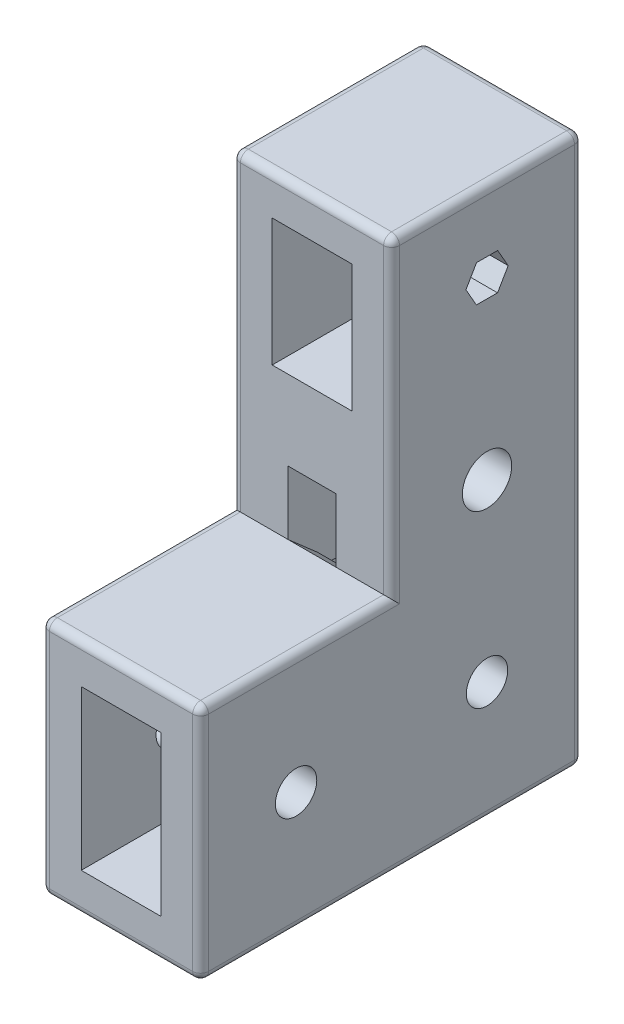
ISO-10303-21;
HEADER;
FILE_DESCRIPTION(('STEP AP214'),'2;1');
FILE_NAME('part.step','',(''),(''),'','','');
FILE_SCHEMA(('AUTOMOTIVE_DESIGN { 1 0 10303 214 1 1 1 1 }'));
ENDSEC;
DATA;
#1=APPLICATION_CONTEXT('core data for automotive mechanical design processes');
#2=APPLICATION_PROTOCOL_DEFINITION('international standard','automotive_design',2000,#1);
#3=PRODUCT_CONTEXT('',#1,'mechanical');
#4=PRODUCT('Part','Part','',(#3));
#5=PRODUCT_RELATED_PRODUCT_CATEGORY('part','',(#4));
#6=PRODUCT_DEFINITION_FORMATION('','',#4);
#7=PRODUCT_DEFINITION_CONTEXT('part definition',#1,'design');
#8=PRODUCT_DEFINITION('design','',#6,#7);
#9=PRODUCT_DEFINITION_SHAPE('','',#8);
#10=(LENGTH_UNIT() NAMED_UNIT(*) SI_UNIT(.MILLI.,.METRE.));
#11=(NAMED_UNIT(*) PLANE_ANGLE_UNIT() SI_UNIT($,.RADIAN.));
#12=(NAMED_UNIT(*) SI_UNIT($,.STERADIAN.) SOLID_ANGLE_UNIT());
#13=UNCERTAINTY_MEASURE_WITH_UNIT(LENGTH_MEASURE(1.E-05),#10,'distance_accuracy_value','');
#14=(GEOMETRIC_REPRESENTATION_CONTEXT(3) GLOBAL_UNCERTAINTY_ASSIGNED_CONTEXT((#13)) GLOBAL_UNIT_ASSIGNED_CONTEXT((#10,
#11,#12)) REPRESENTATION_CONTEXT('',''));
#15=CARTESIAN_POINT('',(0.,0.,0.));
#16=DIRECTION('',(0.,0.,1.));
#17=DIRECTION('',(1.,0.,0.));
#18=AXIS2_PLACEMENT_3D('',#15,#16,#17);
#19=CARTESIAN_POINT('',(0.,23.7785314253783,-9.30263413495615));
#20=DIRECTION('',(0.,0.496875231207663,-0.867821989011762));
#21=DIRECTION('',(0.,0.867821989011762,0.496875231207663));
#22=AXIS2_PLACEMENT_3D('',#19,#20,#21);
#23=PLANE('',#22);
#24=DIRECTION('',(1.,0.,0.));
#25=VECTOR('',#24,1.);
#26=CARTESIAN_POINT('',(0.,26.0833028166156,-7.9830273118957));
#27=LINE('',#26,#25);
#28=CARTESIAN_POINT('',(15.,26.0833028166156,-7.9830273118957));
#29=VERTEX_POINT('',#28);
#30=CARTESIAN_POINT('',(20.,26.0833028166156,-7.9830273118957));
#31=VERTEX_POINT('',#30);
#32=EDGE_CURVE('E823',#29,#31,#27,.T.);
#33=ORIENTED_EDGE('',*,*,#32,.F.);
#34=DIRECTION('',(0.,-0.867821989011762,-0.496875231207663));
#35=VECTOR('',#34,1.);
#36=CARTESIAN_POINT('',(15.,23.7785314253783,-9.30263413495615));
#37=LINE('',#36,#35);
#38=CARTESIAN_POINT('',(15.,23.7785314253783,-9.30263413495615));
#39=VERTEX_POINT('',#38);
#40=EDGE_CURVE('E463',#29,#39,#37,.T.);
#41=ORIENTED_EDGE('',*,*,#40,.T.);
#42=DIRECTION('',(1.,0.,0.));
#43=VECTOR('',#42,1.);
#44=CARTESIAN_POINT('',(0.,23.7785314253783,-9.30263413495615));
#45=LINE('',#44,#43);
#46=CARTESIAN_POINT('',(20.,23.7785314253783,-9.30263413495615));
#47=VERTEX_POINT('',#46);
#48=EDGE_CURVE('E748',#39,#47,#45,.T.);
#49=ORIENTED_EDGE('',*,*,#48,.T.);
#50=DIRECTION('',(0.,0.867821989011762,0.496875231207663));
#51=VECTOR('',#50,1.);
#52=CARTESIAN_POINT('',(20.,23.7785314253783,-9.30263413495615));
#53=LINE('',#52,#51);
#54=EDGE_CURVE('E773',#47,#31,#53,.T.);
#55=ORIENTED_EDGE('',*,*,#54,.T.);
#56=EDGE_LOOP('',(#33,#41,#49,#55));
#57=FACE_BOUND('',#56,.T.);
#58=ADVANCED_FACE('F52',(#57),#23,.F.);
#59=CARTESIAN_POINT('',(0.,21.4833326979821,-7.96644697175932));
#60=DIRECTION('',(0.,-0.503118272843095,-0.864217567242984));
#61=DIRECTION('',(0.,0.864217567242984,-0.503118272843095));
#62=AXIS2_PLACEMENT_3D('',#59,#60,#61);
#63=PLANE('',#62);
#64=ORIENTED_EDGE('',*,*,#48,.F.);
#65=DIRECTION('',(0.,-0.864217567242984,0.503118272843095));
#66=VECTOR('',#65,1.);
#67=CARTESIAN_POINT('',(15.,21.4833326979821,-7.96644697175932));
#68=LINE('',#67,#66);
#69=CARTESIAN_POINT('',(15.,21.4833326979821,-7.96644697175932));
#70=VERTEX_POINT('',#69);
#71=EDGE_CURVE('E460',#39,#70,#68,.T.);
#72=ORIENTED_EDGE('',*,*,#71,.T.);
#73=DIRECTION('',(1.,0.,0.));
#74=VECTOR('',#73,1.);
#75=CARTESIAN_POINT('',(0.,21.4833326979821,-7.96644697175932));
#76=LINE('',#75,#74);
#77=CARTESIAN_POINT('',(20.,21.4833326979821,-7.96644697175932));
#78=VERTEX_POINT('',#77);
#79=EDGE_CURVE('E744',#70,#78,#76,.T.);
#80=ORIENTED_EDGE('',*,*,#79,.T.);
#81=DIRECTION('',(0.,0.864217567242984,-0.503118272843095));
#82=VECTOR('',#81,1.);
#83=CARTESIAN_POINT('',(20.,21.4833326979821,-7.96644697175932));
#84=LINE('',#83,#82);
#85=EDGE_CURVE('E752',#78,#47,#84,.T.);
#86=ORIENTED_EDGE('',*,*,#85,.T.);
#87=EDGE_LOOP('',(#64,#72,#80,#86));
#88=FACE_BOUND('',#87,.T.);
#89=ADVANCED_FACE('F708',(#88),#63,.F.);
#90=CARTESIAN_POINT('',(0.,21.4929053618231,-5.31065298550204));
#91=DIRECTION('',(0.,-0.999993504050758,0.00360442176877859));
#92=DIRECTION('',(0.,-0.00360442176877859,-0.999993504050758));
#93=AXIS2_PLACEMENT_3D('',#90,#91,#92);
#94=PLANE('',#93);
#95=ORIENTED_EDGE('',*,*,#79,.F.);
#96=DIRECTION('',(0.,0.00360442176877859,0.999993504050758));
#97=VECTOR('',#96,1.);
#98=CARTESIAN_POINT('',(15.,21.4929053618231,-5.31065298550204));
#99=LINE('',#98,#97);
#100=CARTESIAN_POINT('',(15.,21.4929053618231,-5.31065298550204));
#101=VERTEX_POINT('',#100);
#102=EDGE_CURVE('E455',#70,#101,#99,.T.);
#103=ORIENTED_EDGE('',*,*,#102,.T.);
#104=DIRECTION('',(1.,0.,0.));
#105=VECTOR('',#104,1.);
#106=CARTESIAN_POINT('',(0.,21.4929053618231,-5.31065298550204));
#107=LINE('',#106,#105);
#108=CARTESIAN_POINT('',(20.,21.4929053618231,-5.31065298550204));
#109=VERTEX_POINT('',#108);
#110=EDGE_CURVE('E803',#101,#109,#107,.T.);
#111=ORIENTED_EDGE('',*,*,#110,.T.);
#112=DIRECTION('',(0.,-0.00360442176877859,-0.999993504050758));
#113=VECTOR('',#112,1.);
#114=CARTESIAN_POINT('',(20.,21.4929053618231,-5.31065298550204));
#115=LINE('',#114,#113);
#116=EDGE_CURVE('E757',#109,#78,#115,.T.);
#117=ORIENTED_EDGE('',*,*,#116,.T.);
#118=EDGE_LOOP('',(#95,#103,#111,#117));
#119=FACE_BOUND('',#118,.T.);
#120=ADVANCED_FACE('F719',(#119),#94,.F.);
#121=CARTESIAN_POINT('',(0.,23.7976767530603,-3.9910461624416));
#122=DIRECTION('',(0.,-0.496875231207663,0.867821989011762));
#123=DIRECTION('',(0.,-0.867821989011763,-0.496875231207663));
#124=AXIS2_PLACEMENT_3D('',#121,#122,#123);
#125=PLANE('',#124);
#126=ORIENTED_EDGE('',*,*,#110,.F.);
#127=DIRECTION('',(0.,0.867821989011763,0.496875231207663));
#128=VECTOR('',#127,1.);
#129=CARTESIAN_POINT('',(15.,23.7976767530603,-3.9910461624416));
#130=LINE('',#129,#128);
#131=CARTESIAN_POINT('',(15.,23.7976767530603,-3.99104616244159));
#132=VERTEX_POINT('',#131);
#133=EDGE_CURVE('E446',#101,#132,#130,.T.);
#134=ORIENTED_EDGE('',*,*,#133,.T.);
#135=DIRECTION('',(1.,0.,0.));
#136=VECTOR('',#135,1.);
#137=CARTESIAN_POINT('',(0.,23.7976767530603,-3.9910461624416));
#138=LINE('',#137,#136);
#139=CARTESIAN_POINT('',(20.,23.7976767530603,-3.9910461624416));
#140=VERTEX_POINT('',#139);
#141=EDGE_CURVE('E812',#132,#140,#138,.T.);
#142=ORIENTED_EDGE('',*,*,#141,.T.);
#143=DIRECTION('',(0.,-0.867821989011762,-0.496875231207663));
#144=VECTOR('',#143,1.);
#145=CARTESIAN_POINT('',(20.,23.7976767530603,-3.9910461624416));
#146=LINE('',#145,#144);
#147=EDGE_CURVE('E763',#140,#109,#146,.T.);
#148=ORIENTED_EDGE('',*,*,#147,.T.);
#149=EDGE_LOOP('',(#126,#134,#142,#148));
#150=FACE_BOUND('',#149,.T.);
#151=ADVANCED_FACE('F947',(#150),#125,.F.);
#152=CARTESIAN_POINT('',(0.,26.0928754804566,-5.32723332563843));
#153=DIRECTION('',(0.,0.503118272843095,0.864217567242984));
#154=DIRECTION('',(0.,-0.864217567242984,0.503118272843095));
#155=AXIS2_PLACEMENT_3D('',#152,#153,#154);
#156=PLANE('',#155);
#157=ORIENTED_EDGE('',*,*,#141,.F.);
#158=DIRECTION('',(0.,0.864217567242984,-0.503118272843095));
#159=VECTOR('',#158,1.);
#160=CARTESIAN_POINT('',(15.,26.0928754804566,-5.32723332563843));
#161=LINE('',#160,#159);
#162=CARTESIAN_POINT('',(15.,26.0928754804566,-5.32723332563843));
#163=VERTEX_POINT('',#162);
#164=EDGE_CURVE('E444',#132,#163,#161,.T.);
#165=ORIENTED_EDGE('',*,*,#164,.T.);
#166=DIRECTION('',(1.,0.,0.));
#167=VECTOR('',#166,1.);
#168=CARTESIAN_POINT('',(0.,26.0928754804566,-5.32723332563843));
#169=LINE('',#168,#167);
#170=CARTESIAN_POINT('',(20.,26.0928754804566,-5.32723332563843));
#171=VERTEX_POINT('',#170);
#172=EDGE_CURVE('E816',#163,#171,#169,.T.);
#173=ORIENTED_EDGE('',*,*,#172,.T.);
#174=DIRECTION('',(0.,-0.864217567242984,0.503118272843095));
#175=VECTOR('',#174,1.);
#176=CARTESIAN_POINT('',(20.,26.0928754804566,-5.32723332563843));
#177=LINE('',#176,#175);
#178=EDGE_CURVE('E770',#171,#140,#177,.T.);
#179=ORIENTED_EDGE('',*,*,#178,.T.);
#180=EDGE_LOOP('',(#157,#165,#173,#179));
#181=FACE_BOUND('',#180,.T.);
#182=ADVANCED_FACE('F952',(#181),#156,.F.);
#183=CARTESIAN_POINT('',(0.,26.0833028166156,-7.9830273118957));
#184=DIRECTION('',(0.,0.999993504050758,-0.0036044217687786));
#185=DIRECTION('',(0.,0.0036044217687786,0.999993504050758));
#186=AXIS2_PLACEMENT_3D('',#183,#184,#185);
#187=PLANE('',#186);
#188=ORIENTED_EDGE('',*,*,#172,.F.);
#189=DIRECTION('',(0.,-0.0036044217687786,-0.999993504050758));
#190=VECTOR('',#189,1.);
#191=CARTESIAN_POINT('',(15.,26.0833028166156,-7.9830273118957));
#192=LINE('',#191,#190);
#193=EDGE_CURVE('E957',#163,#29,#192,.T.);
#194=ORIENTED_EDGE('',*,*,#193,.T.);
#195=ORIENTED_EDGE('',*,*,#32,.T.);
#196=DIRECTION('',(0.,0.0036044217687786,0.999993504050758));
#197=VECTOR('',#196,1.);
#198=CARTESIAN_POINT('',(20.,26.0833028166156,-7.9830273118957));
#199=LINE('',#198,#197);
#200=EDGE_CURVE('E772',#31,#171,#199,.T.);
#201=ORIENTED_EDGE('',*,*,#200,.T.);
#202=EDGE_LOOP('',(#188,#194,#195,#201));
#203=FACE_BOUND('',#202,.T.);
#204=ADVANCED_FACE('F935',(#203),#187,.F.);
#205=CARTESIAN_POINT('',(0.,-20.2118959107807,-6.64684014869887));
#206=DIRECTION('',(1.,0.,0.));
#207=DIRECTION('',(0.,0.,-1.));
#208=AXIS2_PLACEMENT_3D('',#205,#206,#207);
#209=CYLINDRICAL_SURFACE('',#208,2.6);
#210=CARTESIAN_POINT('',(15.,-20.2118959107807,-6.64684014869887));
#211=DIRECTION('',(1.,0.,0.));
#212=DIRECTION('',(0.,0.,-1.));
#213=AXIS2_PLACEMENT_3D('',#210,#211,#212);
#214=CIRCLE('',#213,2.6);
#215=CARTESIAN_POINT('',(15.,-20.2118959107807,-9.24684014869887));
#216=VERTEX_POINT('',#215);
#217=EDGE_CURVE('E420',#216,#216,#214,.F.);
#218=ORIENTED_EDGE('',*,*,#217,.T.);
#219=EDGE_LOOP('',(#218));
#220=FACE_BOUND('',#219,.T.);
#221=CARTESIAN_POINT('',(20.,-20.2118959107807,-6.64684014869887));
#222=DIRECTION('',(1.,0.,0.));
#223=DIRECTION('',(0.,0.,-1.));
#224=AXIS2_PLACEMENT_3D('',#221,#222,#223);
#225=CIRCLE('',#224,2.6);
#226=CARTESIAN_POINT('',(20.,-20.2118959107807,-9.24684014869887));
#227=VERTEX_POINT('',#226);
#228=EDGE_CURVE('E840',#227,#227,#225,.T.);
#229=ORIENTED_EDGE('',*,*,#228,.T.);
#230=EDGE_LOOP('',(#229));
#231=FACE_BOUND('',#230,.T.);
#232=ADVANCED_FACE('F924',(#220,#231),#209,.F.);
#233=CARTESIAN_POINT('',(0.,-20.2118959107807,17.3531598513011));
#234=DIRECTION('',(1.,0.,0.));
#235=DIRECTION('',(0.,0.,-1.));
#236=AXIS2_PLACEMENT_3D('',#233,#234,#235);
#237=CYLINDRICAL_SURFACE('',#236,2.6);
#238=CARTESIAN_POINT('',(15.,-20.2118959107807,17.3531598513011));
#239=DIRECTION('',(1.,0.,0.));
#240=DIRECTION('',(0.,0.,-1.));
#241=AXIS2_PLACEMENT_3D('',#238,#239,#240);
#242=CIRCLE('',#241,2.6);
#243=CARTESIAN_POINT('',(15.,-20.2118959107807,14.7531598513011));
#244=VERTEX_POINT('',#243);
#245=EDGE_CURVE('E418',#244,#244,#242,.F.);
#246=ORIENTED_EDGE('',*,*,#245,.T.);
#247=EDGE_LOOP('',(#246));
#248=FACE_BOUND('',#247,.T.);
#249=CARTESIAN_POINT('',(20.,-20.2118959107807,17.3531598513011));
#250=DIRECTION('',(1.,0.,0.));
#251=DIRECTION('',(0.,0.,-1.));
#252=AXIS2_PLACEMENT_3D('',#249,#250,#251);
#253=CIRCLE('',#252,2.6);
#254=CARTESIAN_POINT('',(20.,-20.2118959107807,14.7531598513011));
#255=VERTEX_POINT('',#254);
#256=EDGE_CURVE('E842',#255,#255,#253,.T.);
#257=ORIENTED_EDGE('',*,*,#256,.T.);
#258=EDGE_LOOP('',(#257));
#259=FACE_BOUND('',#258,.T.);
#260=ADVANCED_FACE('F588',(#248,#259),#237,.F.);
#261=CARTESIAN_POINT('',(20.,-35.2118959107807,-18.6468401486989));
#262=DIRECTION('',(0.,0.,1.));
#263=DIRECTION('',(1.,0.,0.));
#264=AXIS2_PLACEMENT_3D('',#261,#262,#263);
#265=PLANE('',#264);
#266=DIRECTION('',(-1.,0.,0.));
#267=VECTOR('',#266,1.);
#268=CARTESIAN_POINT('',(20.,-34.2118959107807,-18.6468401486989));
#269=LINE('',#268,#267);
#270=CARTESIAN_POINT('',(19.,-34.2118959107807,-18.6468401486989));
#271=VERTEX_POINT('',#270);
#272=CARTESIAN_POINT('',(1.,-34.2118959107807,-18.6468401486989));
#273=VERTEX_POINT('',#272);
#274=EDGE_CURVE('E495',#271,#273,#269,.T.);
#275=ORIENTED_EDGE('',*,*,#274,.T.);
#276=DIRECTION('',(0.,1.,0.));
#277=VECTOR('',#276,1.);
#278=CARTESIAN_POINT('',(1.,-35.2118959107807,-18.6468401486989));
#279=LINE('',#278,#277);
#280=CARTESIAN_POINT('',(1.,32.7881040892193,-18.6468401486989));
#281=VERTEX_POINT('',#280);
#282=EDGE_CURVE('E501',#273,#281,#279,.T.);
#283=ORIENTED_EDGE('',*,*,#282,.T.);
#284=DIRECTION('',(-1.,0.,0.));
#285=VECTOR('',#284,1.);
#286=CARTESIAN_POINT('',(20.,32.7881040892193,-18.6468401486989));
#287=LINE('',#286,#285);
#288=CARTESIAN_POINT('',(19.,32.7881040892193,-18.6468401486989));
#289=VERTEX_POINT('',#288);
#290=EDGE_CURVE('E498',#281,#289,#287,.F.);
#291=ORIENTED_EDGE('',*,*,#290,.T.);
#292=DIRECTION('',(0.,1.,0.));
#293=VECTOR('',#292,1.);
#294=CARTESIAN_POINT('',(19.,-35.2118959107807,-18.6468401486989));
#295=LINE('',#294,#293);
#296=EDGE_CURVE('E492',#289,#271,#295,.F.);
#297=ORIENTED_EDGE('',*,*,#296,.T.);
#298=EDGE_LOOP('',(#275,#283,#291,#297));
#299=FACE_BOUND('',#298,.T.);
#300=DIRECTION('',(-1.,0.,0.));
#301=VECTOR('',#300,1.);
#302=CARTESIAN_POINT('',(5.,-30.2118959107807,-18.6468401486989));
#303=LINE('',#302,#301);
#304=CARTESIAN_POINT('',(15.,-30.2118959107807,-18.6468401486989));
#305=VERTEX_POINT('',#304);
#306=CARTESIAN_POINT('',(5.,-30.2118959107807,-18.6468401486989));
#307=VERTEX_POINT('',#306);
#308=EDGE_CURVE('E361',#305,#307,#303,.T.);
#309=ORIENTED_EDGE('',*,*,#308,.F.);
#310=DIRECTION('',(0.,-1.,0.));
#311=VECTOR('',#310,1.);
#312=CARTESIAN_POINT('',(15.,-30.2118959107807,-18.6468401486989));
#313=LINE('',#312,#311);
#314=CARTESIAN_POINT('',(15.,-10.2118959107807,-18.6468401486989));
#315=VERTEX_POINT('',#314);
#316=EDGE_CURVE('E328',#315,#305,#313,.T.);
#317=ORIENTED_EDGE('',*,*,#316,.F.);
#318=DIRECTION('',(1.,0.,0.));
#319=VECTOR('',#318,1.);
#320=CARTESIAN_POINT('',(5.,-10.2118959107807,-18.6468401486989));
#321=LINE('',#320,#319);
#322=CARTESIAN_POINT('',(5.,-10.2118959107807,-18.6468401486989));
#323=VERTEX_POINT('',#322);
#324=EDGE_CURVE('E348',#323,#315,#321,.T.);
#325=ORIENTED_EDGE('',*,*,#324,.F.);
#326=DIRECTION('',(0.,1.,0.));
#327=VECTOR('',#326,1.);
#328=CARTESIAN_POINT('',(5.,-30.2118959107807,-18.6468401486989));
#329=LINE('',#328,#327);
#330=EDGE_CURVE('E352',#307,#323,#329,.T.);
#331=ORIENTED_EDGE('',*,*,#330,.F.);
#332=EDGE_LOOP('',(#309,#317,#325,#331));
#333=FACE_BOUND('',#332,.T.);
#334=DIRECTION('',(-1.,0.,0.));
#335=VECTOR('',#334,1.);
#336=CARTESIAN_POINT('',(5.,12.7881040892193,-18.6468401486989));
#337=LINE('',#336,#335);
#338=CARTESIAN_POINT('',(15.,12.7881040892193,-18.6468401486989));
#339=VERTEX_POINT('',#338);
#340=CARTESIAN_POINT('',(5.,12.7881040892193,-18.6468401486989));
#341=VERTEX_POINT('',#340);
#342=EDGE_CURVE('E399',#339,#341,#337,.T.);
#343=ORIENTED_EDGE('',*,*,#342,.F.);
#344=DIRECTION('',(0.,-1.,0.));
#345=VECTOR('',#344,1.);
#346=CARTESIAN_POINT('',(15.,12.7881040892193,-18.6468401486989));
#347=LINE('',#346,#345);
#348=CARTESIAN_POINT('',(15.,28.7881040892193,-18.6468401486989));
#349=VERTEX_POINT('',#348);
#350=EDGE_CURVE('E364',#349,#339,#347,.T.);
#351=ORIENTED_EDGE('',*,*,#350,.F.);
#352=DIRECTION('',(1.,0.,0.));
#353=VECTOR('',#352,1.);
#354=CARTESIAN_POINT('',(5.,28.7881040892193,-18.6468401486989));
#355=LINE('',#354,#353);
#356=CARTESIAN_POINT('',(5.,28.7881040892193,-18.6468401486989));
#357=VERTEX_POINT('',#356);
#358=EDGE_CURVE('E384',#357,#349,#355,.T.);
#359=ORIENTED_EDGE('',*,*,#358,.F.);
#360=DIRECTION('',(0.,1.,0.));
#361=VECTOR('',#360,1.);
#362=CARTESIAN_POINT('',(5.,12.7881040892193,-18.6468401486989));
#363=LINE('',#362,#361);
#364=EDGE_CURVE('E398',#341,#357,#363,.T.);
#365=ORIENTED_EDGE('',*,*,#364,.F.);
#366=EDGE_LOOP('',(#343,#351,#359,#365));
#367=FACE_BOUND('',#366,.T.);
#368=ADVANCED_FACE('F579',(#299,#333,#367),#265,.F.);
#369=CARTESIAN_POINT('',(20.,33.7881040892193,5.35315985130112));
#370=DIRECTION('',(0.,0.,-1.));
#371=DIRECTION('',(0.,1.,0.));
#372=AXIS2_PLACEMENT_3D('',#369,#370,#371);
#373=PLANE('',#372);
#374=DIRECTION('',(1.,0.,0.));
#375=VECTOR('',#374,1.);
#376=CARTESIAN_POINT('',(20.,28.7881040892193,5.35315985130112));
#377=LINE('',#376,#375);
#378=CARTESIAN_POINT('',(5.,28.7881040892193,5.35315985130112));
#379=VERTEX_POINT('',#378);
#380=CARTESIAN_POINT('',(15.,28.7881040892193,5.35315985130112));
#381=VERTEX_POINT('',#380);
#382=EDGE_CURVE('E966',#379,#381,#377,.T.);
#383=ORIENTED_EDGE('',*,*,#382,.T.);
#384=DIRECTION('',(0.,-1.,0.));
#385=VECTOR('',#384,1.);
#386=CARTESIAN_POINT('',(15.,33.7881040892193,5.35315985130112));
#387=LINE('',#386,#385);
#388=CARTESIAN_POINT('',(15.,12.7881040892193,5.35315985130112));
#389=VERTEX_POINT('',#388);
#390=EDGE_CURVE('E464',#381,#389,#387,.T.);
#391=ORIENTED_EDGE('',*,*,#390,.T.);
#392=DIRECTION('',(-1.,0.,0.));
#393=VECTOR('',#392,1.);
#394=CARTESIAN_POINT('',(20.,12.7881040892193,5.35315985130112));
#395=LINE('',#394,#393);
#396=CARTESIAN_POINT('',(5.,12.7881040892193,5.35315985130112));
#397=VERTEX_POINT('',#396);
#398=EDGE_CURVE('E962',#389,#397,#395,.T.);
#399=ORIENTED_EDGE('',*,*,#398,.T.);
#400=DIRECTION('',(0.,1.,0.));
#401=VECTOR('',#400,1.);
#402=CARTESIAN_POINT('',(5.,33.7881040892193,5.35315985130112));
#403=LINE('',#402,#401);
#404=EDGE_CURVE('E441',#397,#379,#403,.T.);
#405=ORIENTED_EDGE('',*,*,#404,.T.);
#406=EDGE_LOOP('',(#383,#391,#399,#405));
#407=FACE_BOUND('',#406,.T.);
#408=DIRECTION('',(-1.,0.,0.));
#409=VECTOR('',#408,1.);
#410=CARTESIAN_POINT('',(20.,-5.21189591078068,5.35315985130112));
#411=LINE('',#410,#409);
#412=CARTESIAN_POINT('',(19.,-5.21189591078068,5.35315985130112));
#413=VERTEX_POINT('',#412);
#414=CARTESIAN_POINT('',(13.,-5.21189591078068,5.35315985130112));
#415=VERTEX_POINT('',#414);
#416=EDGE_CURVE('E540',#413,#415,#411,.T.);
#417=ORIENTED_EDGE('',*,*,#416,.F.);
#418=DIRECTION('',(0.,-1.,0.));
#419=VECTOR('',#418,1.);
#420=CARTESIAN_POINT('',(19.,33.7881040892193,5.35315985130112));
#421=LINE('',#420,#419);
#422=CARTESIAN_POINT('',(19.,32.7881040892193,5.35315985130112));
#423=VERTEX_POINT('',#422);
#424=EDGE_CURVE('E1007',#413,#423,#421,.F.);
#425=ORIENTED_EDGE('',*,*,#424,.T.);
#426=DIRECTION('',(-1.,0.,0.));
#427=VECTOR('',#426,1.);
#428=CARTESIAN_POINT('',(20.,32.7881040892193,5.35315985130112));
#429=LINE('',#428,#427);
#430=CARTESIAN_POINT('',(1.,32.7881040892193,5.35315985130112));
#431=VERTEX_POINT('',#430);
#432=EDGE_CURVE('E1026',#423,#431,#429,.T.);
#433=ORIENTED_EDGE('',*,*,#432,.T.);
#434=DIRECTION('',(0.,-1.,0.));
#435=VECTOR('',#434,1.);
#436=CARTESIAN_POINT('',(1.,33.7881040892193,5.35315985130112));
#437=LINE('',#436,#435);
#438=CARTESIAN_POINT('',(1.,-5.21189591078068,5.35315985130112));
#439=VERTEX_POINT('',#438);
#440=EDGE_CURVE('E539',#431,#439,#437,.T.);
#441=ORIENTED_EDGE('',*,*,#440,.T.);
#442=CARTESIAN_POINT('',(7.,-5.21189591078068,5.35315985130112));
#443=VERTEX_POINT('',#442);
#444=EDGE_CURVE('E544',#443,#439,#411,.T.);
#445=ORIENTED_EDGE('',*,*,#444,.F.);
#446=DIRECTION('',(0.,-1.,0.));
#447=VECTOR('',#446,1.);
#448=CARTESIAN_POINT('',(7.,-5.21189591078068,5.35315985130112));
#449=LINE('',#448,#447);
#450=CARTESIAN_POINT('',(7.,2.78810408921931,5.35315985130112));
#451=VERTEX_POINT('',#450);
#452=EDGE_CURVE('E860',#451,#443,#449,.T.);
#453=ORIENTED_EDGE('',*,*,#452,.F.);
#454=DIRECTION('',(-1.,0.,0.));
#455=VECTOR('',#454,1.);
#456=CARTESIAN_POINT('',(7.,2.78810408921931,5.35315985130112));
#457=LINE('',#456,#455);
#458=CARTESIAN_POINT('',(13.,2.78810408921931,5.35315985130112));
#459=VERTEX_POINT('',#458);
#460=EDGE_CURVE('E561',#459,#451,#457,.T.);
#461=ORIENTED_EDGE('',*,*,#460,.F.);
#462=DIRECTION('',(0.,1.,0.));
#463=VECTOR('',#462,1.);
#464=CARTESIAN_POINT('',(13.,-5.21189591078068,5.35315985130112));
#465=LINE('',#464,#463);
#466=EDGE_CURVE('E857',#415,#459,#465,.T.);
#467=ORIENTED_EDGE('',*,*,#466,.F.);
#468=EDGE_LOOP('',(#417,#425,#433,#441,#445,#453,#461,#467));
#469=FACE_BOUND('',#468,.T.);
#470=ADVANCED_FACE('F568',(#407,#469),#373,.F.);
#471=CARTESIAN_POINT('',(20.,-5.21189591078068,29.3531598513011));
#472=DIRECTION('',(0.,0.,-1.));
#473=DIRECTION('',(-1.,0.,0.));
#474=AXIS2_PLACEMENT_3D('',#471,#472,#473);
#475=PLANE('',#474);
#476=DIRECTION('',(-1.,0.,0.));
#477=VECTOR('',#476,1.);
#478=CARTESIAN_POINT('',(20.,-34.2118959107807,29.3531598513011));
#479=LINE('',#478,#477);
#480=CARTESIAN_POINT('',(1.,-34.2118959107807,29.3531598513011));
#481=VERTEX_POINT('',#480);
#482=CARTESIAN_POINT('',(19.,-34.2118959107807,29.3531598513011));
#483=VERTEX_POINT('',#482);
#484=EDGE_CURVE('E65',#481,#483,#479,.F.);
#485=ORIENTED_EDGE('',*,*,#484,.T.);
#486=DIRECTION('',(0.,-1.,0.));
#487=VECTOR('',#486,1.);
#488=CARTESIAN_POINT('',(19.,-5.21189591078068,29.3531598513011));
#489=LINE('',#488,#487);
#490=CARTESIAN_POINT('',(19.,-6.21189591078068,29.3531598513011));
#491=VERTEX_POINT('',#490);
#492=EDGE_CURVE('E12',#483,#491,#489,.F.);
#493=ORIENTED_EDGE('',*,*,#492,.T.);
#494=DIRECTION('',(-1.,0.,0.));
#495=VECTOR('',#494,1.);
#496=CARTESIAN_POINT('',(20.,-6.21189591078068,29.3531598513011));
#497=LINE('',#496,#495);
#498=CARTESIAN_POINT('',(1.,-6.21189591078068,29.3531598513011));
#499=VERTEX_POINT('',#498);
#500=EDGE_CURVE('E1066',#491,#499,#497,.T.);
#501=ORIENTED_EDGE('',*,*,#500,.T.);
#502=DIRECTION('',(0.,-1.,0.));
#503=VECTOR('',#502,1.);
#504=CARTESIAN_POINT('',(1.,-5.21189591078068,29.3531598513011));
#505=LINE('',#504,#503);
#506=EDGE_CURVE('E72',#499,#481,#505,.T.);
#507=ORIENTED_EDGE('',*,*,#506,.T.);
#508=EDGE_LOOP('',(#485,#493,#501,#507));
#509=FACE_BOUND('',#508,.T.);
#510=DIRECTION('',(1.,0.,0.));
#511=VECTOR('',#510,1.);
#512=CARTESIAN_POINT('',(5.,-10.2118959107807,29.3531598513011));
#513=LINE('',#512,#511);
#514=CARTESIAN_POINT('',(5.,-10.2118959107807,29.3531598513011));
#515=VERTEX_POINT('',#514);
#516=CARTESIAN_POINT('',(15.,-10.2118959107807,29.3531598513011));
#517=VERTEX_POINT('',#516);
#518=EDGE_CURVE('E337',#515,#517,#513,.T.);
#519=ORIENTED_EDGE('',*,*,#518,.T.);
#520=DIRECTION('',(0.,-1.,0.));
#521=VECTOR('',#520,1.);
#522=CARTESIAN_POINT('',(15.,-30.2118959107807,29.3531598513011));
#523=LINE('',#522,#521);
#524=CARTESIAN_POINT('',(15.,-30.2118959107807,29.3531598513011));
#525=VERTEX_POINT('',#524);
#526=EDGE_CURVE('E330',#517,#525,#523,.T.);
#527=ORIENTED_EDGE('',*,*,#526,.T.);
#528=DIRECTION('',(-1.,0.,0.));
#529=VECTOR('',#528,1.);
#530=CARTESIAN_POINT('',(5.,-30.2118959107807,29.3531598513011));
#531=LINE('',#530,#529);
#532=CARTESIAN_POINT('',(5.,-30.2118959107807,29.3531598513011));
#533=VERTEX_POINT('',#532);
#534=EDGE_CURVE('E338',#525,#533,#531,.T.);
#535=ORIENTED_EDGE('',*,*,#534,.T.);
#536=DIRECTION('',(0.,1.,0.));
#537=VECTOR('',#536,1.);
#538=CARTESIAN_POINT('',(5.,-30.2118959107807,29.3531598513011));
#539=LINE('',#538,#537);
#540=EDGE_CURVE('E343',#533,#515,#539,.T.);
#541=ORIENTED_EDGE('',*,*,#540,.T.);
#542=EDGE_LOOP('',(#519,#527,#535,#541));
#543=FACE_BOUND('',#542,.T.);
#544=ADVANCED_FACE('F350',(#509,#543),#475,.F.);
#545=CARTESIAN_POINT('',(20.,-35.2118959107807,29.3531598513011));
#546=DIRECTION('',(0.,1.,0.));
#547=DIRECTION('',(0.,0.,1.));
#548=AXIS2_PLACEMENT_3D('',#545,#546,#547);
#549=PLANE('',#548);
#550=DIRECTION('',(0.,0.,-1.));
#551=VECTOR('',#550,1.);
#552=CARTESIAN_POINT('',(1.,-35.2118959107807,29.3531598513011));
#553=LINE('',#552,#551);
#554=CARTESIAN_POINT('',(1.,-35.2118959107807,28.3531598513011));
#555=VERTEX_POINT('',#554);
#556=CARTESIAN_POINT('',(1.,-35.2118959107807,-17.6468401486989));
#557=VERTEX_POINT('',#556);
#558=EDGE_CURVE('E1060',#555,#557,#553,.T.);
#559=ORIENTED_EDGE('',*,*,#558,.T.);
#560=DIRECTION('',(-1.,0.,0.));
#561=VECTOR('',#560,1.);
#562=CARTESIAN_POINT('',(20.,-35.2118959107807,-17.6468401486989));
#563=LINE('',#562,#561);
#564=CARTESIAN_POINT('',(19.,-35.2118959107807,-17.6468401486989));
#565=VERTEX_POINT('',#564);
#566=EDGE_CURVE('E1061',#557,#565,#563,.F.);
#567=ORIENTED_EDGE('',*,*,#566,.T.);
#568=DIRECTION('',(0.,0.,-1.));
#569=VECTOR('',#568,1.);
#570=CARTESIAN_POINT('',(19.,-35.2118959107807,29.3531598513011));
#571=LINE('',#570,#569);
#572=CARTESIAN_POINT('',(19.,-35.2118959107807,28.3531598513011));
#573=VERTEX_POINT('',#572);
#574=EDGE_CURVE('E1062',#565,#573,#571,.F.);
#575=ORIENTED_EDGE('',*,*,#574,.T.);
#576=DIRECTION('',(-1.,0.,0.));
#577=VECTOR('',#576,1.);
#578=CARTESIAN_POINT('',(20.,-35.2118959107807,28.3531598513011));
#579=LINE('',#578,#577);
#580=EDGE_CURVE('E1053',#573,#555,#579,.T.);
#581=ORIENTED_EDGE('',*,*,#580,.T.);
#582=EDGE_LOOP('',(#559,#567,#575,#581));
#583=FACE_BOUND('',#582,.T.);
#584=ADVANCED_FACE('F587',(#583),#549,.F.);
#585=CARTESIAN_POINT('',(20.,33.7881040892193,-18.6468401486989));
#586=DIRECTION('',(0.,-1.,0.));
#587=DIRECTION('',(0.,0.,-1.));
#588=AXIS2_PLACEMENT_3D('',#585,#586,#587);
#589=PLANE('',#588);
#590=DIRECTION('',(0.,0.,1.));
#591=VECTOR('',#590,1.);
#592=CARTESIAN_POINT('',(19.,33.7881040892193,-18.6468401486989));
#593=LINE('',#592,#591);
#594=CARTESIAN_POINT('',(19.,33.7881040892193,4.35315985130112));
#595=VERTEX_POINT('',#594);
#596=CARTESIAN_POINT('',(19.,33.7881040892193,-17.6468401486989));
#597=VERTEX_POINT('',#596);
#598=EDGE_CURVE('E521',#595,#597,#593,.F.);
#599=ORIENTED_EDGE('',*,*,#598,.T.);
#600=DIRECTION('',(-1.,0.,0.));
#601=VECTOR('',#600,1.);
#602=CARTESIAN_POINT('',(20.,33.7881040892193,-17.6468401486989));
#603=LINE('',#602,#601);
#604=CARTESIAN_POINT('',(1.,33.7881040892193,-17.6468401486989));
#605=VERTEX_POINT('',#604);
#606=EDGE_CURVE('E531',#597,#605,#603,.T.);
#607=ORIENTED_EDGE('',*,*,#606,.T.);
#608=DIRECTION('',(0.,0.,1.));
#609=VECTOR('',#608,1.);
#610=CARTESIAN_POINT('',(1.,33.7881040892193,-18.6468401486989));
#611=LINE('',#610,#609);
#612=CARTESIAN_POINT('',(1.,33.7881040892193,4.35315985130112));
#613=VERTEX_POINT('',#612);
#614=EDGE_CURVE('E529',#605,#613,#611,.T.);
#615=ORIENTED_EDGE('',*,*,#614,.T.);
#616=DIRECTION('',(-1.,0.,0.));
#617=VECTOR('',#616,1.);
#618=CARTESIAN_POINT('',(20.,33.7881040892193,4.35315985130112));
#619=LINE('',#618,#617);
#620=EDGE_CURVE('E530',#613,#595,#619,.F.);
#621=ORIENTED_EDGE('',*,*,#620,.T.);
#622=EDGE_LOOP('',(#599,#607,#615,#621));
#623=FACE_BOUND('',#622,.T.);
#624=ADVANCED_FACE('F585',(#623),#589,.F.);
#625=CARTESIAN_POINT('',(20.,-5.21189591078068,5.35315985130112));
#626=DIRECTION('',(0.,-1.,0.));
#627=DIRECTION('',(0.,0.,-1.));
#628=AXIS2_PLACEMENT_3D('',#625,#626,#627);
#629=PLANE('',#628);
#630=DIRECTION('',(-1.,0.,0.));
#631=VECTOR('',#630,1.);
#632=CARTESIAN_POINT('',(20.,-5.21189591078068,28.3531598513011));
#633=LINE('',#632,#631);
#634=CARTESIAN_POINT('',(1.,-5.21189591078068,28.3531598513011));
#635=VERTEX_POINT('',#634);
#636=CARTESIAN_POINT('',(19.,-5.21189591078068,28.3531598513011));
#637=VERTEX_POINT('',#636);
#638=EDGE_CURVE('E1050',#635,#637,#633,.F.);
#639=ORIENTED_EDGE('',*,*,#638,.T.);
#640=DIRECTION('',(0.,0.,1.));
#641=VECTOR('',#640,1.);
#642=CARTESIAN_POINT('',(19.,-5.21189591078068,5.35315985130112));
#643=LINE('',#642,#641);
#644=EDGE_CURVE('E1014',#637,#413,#643,.F.);
#645=ORIENTED_EDGE('',*,*,#644,.T.);
#646=ORIENTED_EDGE('',*,*,#416,.T.);
#647=DIRECTION('',(1.,0.,0.));
#648=VECTOR('',#647,1.);
#649=CARTESIAN_POINT('',(7.,-5.21189591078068,5.35315985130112));
#650=LINE('',#649,#648);
#651=EDGE_CURVE('E755',#443,#415,#650,.T.);
#652=ORIENTED_EDGE('',*,*,#651,.F.);
#653=ORIENTED_EDGE('',*,*,#444,.T.);
#654=DIRECTION('',(0.,0.,1.));
#655=VECTOR('',#654,1.);
#656=CARTESIAN_POINT('',(1.,-5.21189591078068,5.35315985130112));
#657=LINE('',#656,#655);
#658=EDGE_CURVE('E1049',#439,#635,#657,.T.);
#659=ORIENTED_EDGE('',*,*,#658,.T.);
#660=EDGE_LOOP('',(#639,#645,#646,#652,#653,#659));
#661=FACE_BOUND('',#660,.T.);
#662=ADVANCED_FACE('F578',(#661),#629,.F.);
#663=CARTESIAN_POINT('',(20.,0.,0.));
#664=DIRECTION('',(1.,0.,0.));
#665=DIRECTION('',(0.,0.,-1.));
#666=AXIS2_PLACEMENT_3D('',#663,#664,#665);
#667=PLANE('',#666);
#668=DIRECTION('',(0.,1.,0.));
#669=VECTOR('',#668,1.);
#670=CARTESIAN_POINT('',(20.,33.7881040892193,-17.6468401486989));
#671=LINE('',#670,#669);
#672=CARTESIAN_POINT('',(20.,-34.2118959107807,-17.6468401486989));
#673=VERTEX_POINT('',#672);
#674=CARTESIAN_POINT('',(20.,32.7881040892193,-17.6468401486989));
#675=VERTEX_POINT('',#674);
#676=EDGE_CURVE('E1038',#673,#675,#671,.T.);
#677=ORIENTED_EDGE('',*,*,#676,.T.);
#678=DIRECTION('',(0.,0.,1.));
#679=VECTOR('',#678,1.);
#680=CARTESIAN_POINT('',(20.,32.7881040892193,5.35315985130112));
#681=LINE('',#680,#679);
#682=CARTESIAN_POINT('',(20.,32.7881040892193,4.35315985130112));
#683=VERTEX_POINT('',#682);
#684=EDGE_CURVE('E1044',#675,#683,#681,.T.);
#685=ORIENTED_EDGE('',*,*,#684,.T.);
#686=DIRECTION('',(0.,-1.,0.));
#687=VECTOR('',#686,1.);
#688=CARTESIAN_POINT('',(20.,-5.21189591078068,4.35315985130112));
#689=LINE('',#688,#687);
#690=CARTESIAN_POINT('',(20.,-6.21189591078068,4.35315985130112));
#691=VERTEX_POINT('',#690);
#692=EDGE_CURVE('E1039',#683,#691,#689,.T.);
#693=ORIENTED_EDGE('',*,*,#692,.T.);
#694=DIRECTION('',(0.,0.,1.));
#695=VECTOR('',#694,1.);
#696=CARTESIAN_POINT('',(20.,-6.21189591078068,29.3531598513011));
#697=LINE('',#696,#695);
#698=CARTESIAN_POINT('',(20.,-6.21189591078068,28.3531598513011));
#699=VERTEX_POINT('',#698);
#700=EDGE_CURVE('E1012',#691,#699,#697,.T.);
#701=ORIENTED_EDGE('',*,*,#700,.T.);
#702=DIRECTION('',(0.,-1.,0.));
#703=VECTOR('',#702,1.);
#704=CARTESIAN_POINT('',(20.,-35.2118959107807,28.3531598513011));
#705=LINE('',#704,#703);
#706=CARTESIAN_POINT('',(20.,-34.2118959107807,28.3531598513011));
#707=VERTEX_POINT('',#706);
#708=EDGE_CURVE('E1024',#699,#707,#705,.T.);
#709=ORIENTED_EDGE('',*,*,#708,.T.);
#710=DIRECTION('',(0.,0.,-1.));
#711=VECTOR('',#710,1.);
#712=CARTESIAN_POINT('',(20.,-34.2118959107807,-18.6468401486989));
#713=LINE('',#712,#711);
#714=EDGE_CURVE('E1029',#707,#673,#713,.T.);
#715=ORIENTED_EDGE('',*,*,#714,.T.);
#716=EDGE_LOOP('',(#677,#685,#693,#701,#709,#715));
#717=FACE_BOUND('',#716,.T.);
#718=ORIENTED_EDGE('',*,*,#256,.F.);
#719=EDGE_LOOP('',(#718));
#720=FACE_BOUND('',#719,.T.);
#721=ORIENTED_EDGE('',*,*,#228,.F.);
#722=EDGE_LOOP('',(#721));
#723=FACE_BOUND('',#722,.T.);
#724=CARTESIAN_POINT('',(20.,1.78810408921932,-6.64684014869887));
#725=DIRECTION('',(1.,0.,0.));
#726=DIRECTION('',(0.,0.,-1.));
#727=AXIS2_PLACEMENT_3D('',#724,#725,#726);
#728=CIRCLE('',#727,3.1);
#729=CARTESIAN_POINT('',(20.,1.78810408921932,-9.74684014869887));
#730=VERTEX_POINT('',#729);
#731=EDGE_CURVE('E827',#730,#730,#728,.T.);
#732=ORIENTED_EDGE('',*,*,#731,.F.);
#733=EDGE_LOOP('',(#732));
#734=FACE_BOUND('',#733,.T.);
#735=ORIENTED_EDGE('',*,*,#54,.F.);
#736=ORIENTED_EDGE('',*,*,#85,.F.);
#737=ORIENTED_EDGE('',*,*,#116,.F.);
#738=ORIENTED_EDGE('',*,*,#147,.F.);
#739=ORIENTED_EDGE('',*,*,#178,.F.);
#740=ORIENTED_EDGE('',*,*,#200,.F.);
#741=EDGE_LOOP('',(#735,#736,#737,#738,#739,#740));
#742=FACE_BOUND('',#741,.T.);
#743=ADVANCED_FACE('F733',(#717,#720,#723,#734,#742),#667,.T.);
#744=CARTESIAN_POINT('',(0.,0.,0.));
#745=DIRECTION('',(1.,0.,0.));
#746=DIRECTION('',(0.,0.,-1.));
#747=AXIS2_PLACEMENT_3D('',#744,#745,#746);
#748=PLANE('',#747);
#749=DIRECTION('',(0.,-1.,0.));
#750=VECTOR('',#749,1.);
#751=CARTESIAN_POINT('',(0.,0.,4.35315985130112));
#752=LINE('',#751,#750);
#753=CARTESIAN_POINT('',(0.,-6.21189591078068,4.35315985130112));
#754=VERTEX_POINT('',#753);
#755=CARTESIAN_POINT('',(0.,32.7881040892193,4.35315985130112));
#756=VERTEX_POINT('',#755);
#757=EDGE_CURVE('E520',#754,#756,#752,.F.);
#758=ORIENTED_EDGE('',*,*,#757,.T.);
#759=DIRECTION('',(0.,0.,1.));
#760=VECTOR('',#759,1.);
#761=CARTESIAN_POINT('',(0.,32.7881040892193,0.));
#762=LINE('',#761,#760);
#763=CARTESIAN_POINT('',(0.,32.7881040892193,-17.6468401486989));
#764=VERTEX_POINT('',#763);
#765=EDGE_CURVE('E522',#756,#764,#762,.F.);
#766=ORIENTED_EDGE('',*,*,#765,.T.);
#767=DIRECTION('',(0.,1.,0.));
#768=VECTOR('',#767,1.);
#769=CARTESIAN_POINT('',(0.,0.,-17.6468401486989));
#770=LINE('',#769,#768);
#771=CARTESIAN_POINT('',(0.,-34.2118959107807,-17.6468401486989));
#772=VERTEX_POINT('',#771);
#773=EDGE_CURVE('E511',#764,#772,#770,.F.);
#774=ORIENTED_EDGE('',*,*,#773,.T.);
#775=DIRECTION('',(0.,0.,-1.));
#776=VECTOR('',#775,1.);
#777=CARTESIAN_POINT('',(0.,-34.2118959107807,0.));
#778=LINE('',#777,#776);
#779=CARTESIAN_POINT('',(0.,-34.2118959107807,28.3531598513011));
#780=VERTEX_POINT('',#779);
#781=EDGE_CURVE('E507',#772,#780,#778,.F.);
#782=ORIENTED_EDGE('',*,*,#781,.T.);
#783=DIRECTION('',(0.,-1.,0.));
#784=VECTOR('',#783,1.);
#785=CARTESIAN_POINT('',(0.,0.,28.3531598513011));
#786=LINE('',#785,#784);
#787=CARTESIAN_POINT('',(0.,-6.21189591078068,28.3531598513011));
#788=VERTEX_POINT('',#787);
#789=EDGE_CURVE('E504',#780,#788,#786,.F.);
#790=ORIENTED_EDGE('',*,*,#789,.T.);
#791=DIRECTION('',(0.,0.,1.));
#792=VECTOR('',#791,1.);
#793=CARTESIAN_POINT('',(0.,-6.21189591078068,0.));
#794=LINE('',#793,#792);
#795=EDGE_CURVE('E512',#788,#754,#794,.F.);
#796=ORIENTED_EDGE('',*,*,#795,.T.);
#797=EDGE_LOOP('',(#758,#766,#774,#782,#790,#796));
#798=FACE_BOUND('',#797,.T.);
#799=CARTESIAN_POINT('',(0.,-20.2118959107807,17.3531598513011));
#800=DIRECTION('',(1.,0.,0.));
#801=DIRECTION('',(0.,0.,-1.));
#802=AXIS2_PLACEMENT_3D('',#799,#800,#801);
#803=CIRCLE('',#802,2.6);
#804=CARTESIAN_POINT('',(0.,-20.2118959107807,14.7531598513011));
#805=VERTEX_POINT('',#804);
#806=EDGE_CURVE('E555',#805,#805,#803,.T.);
#807=ORIENTED_EDGE('',*,*,#806,.T.);
#808=EDGE_LOOP('',(#807));
#809=FACE_BOUND('',#808,.T.);
#810=CARTESIAN_POINT('',(0.,-20.2118959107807,-6.64684014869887));
#811=DIRECTION('',(1.,0.,0.));
#812=DIRECTION('',(0.,0.,-1.));
#813=AXIS2_PLACEMENT_3D('',#810,#811,#812);
#814=CIRCLE('',#813,2.6);
#815=CARTESIAN_POINT('',(0.,-20.2118959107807,-9.24684014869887));
#816=VERTEX_POINT('',#815);
#817=EDGE_CURVE('E832',#816,#816,#814,.T.);
#818=ORIENTED_EDGE('',*,*,#817,.T.);
#819=EDGE_LOOP('',(#818));
#820=FACE_BOUND('',#819,.T.);
#821=CARTESIAN_POINT('',(0.,1.78810408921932,-6.64684014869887));
#822=DIRECTION('',(1.,0.,0.));
#823=DIRECTION('',(0.,0.,-1.));
#824=AXIS2_PLACEMENT_3D('',#821,#822,#823);
#825=CIRCLE('',#824,3.1);
#826=CARTESIAN_POINT('',(0.,1.78810408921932,-9.74684014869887));
#827=VERTEX_POINT('',#826);
#828=EDGE_CURVE('E776',#827,#827,#825,.T.);
#829=ORIENTED_EDGE('',*,*,#828,.T.);
#830=EDGE_LOOP('',(#829));
#831=FACE_BOUND('',#830,.T.);
#832=DIRECTION('',(0.,0.864217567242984,-0.503118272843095));
#833=VECTOR('',#832,1.);
#834=CARTESIAN_POINT('',(0.,21.4833326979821,-7.96644697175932));
#835=LINE('',#834,#833);
#836=CARTESIAN_POINT('',(0.,21.4833326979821,-7.96644697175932));
#837=VERTEX_POINT('',#836);
#838=CARTESIAN_POINT('',(0.,23.7785314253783,-9.30263413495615));
#839=VERTEX_POINT('',#838);
#840=EDGE_CURVE('E778',#837,#839,#835,.T.);
#841=ORIENTED_EDGE('',*,*,#840,.T.);
#842=DIRECTION('',(0.,0.867821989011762,0.496875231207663));
#843=VECTOR('',#842,1.);
#844=CARTESIAN_POINT('',(0.,23.7785314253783,-9.30263413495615));
#845=LINE('',#844,#843);
#846=CARTESIAN_POINT('',(0.,26.0833028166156,-7.9830273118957));
#847=VERTEX_POINT('',#846);
#848=EDGE_CURVE('E546',#839,#847,#845,.T.);
#849=ORIENTED_EDGE('',*,*,#848,.T.);
#850=DIRECTION('',(0.,0.0036044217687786,0.999993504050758));
#851=VECTOR('',#850,1.);
#852=CARTESIAN_POINT('',(0.,26.0833028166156,-7.9830273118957));
#853=LINE('',#852,#851);
#854=CARTESIAN_POINT('',(0.,26.0928754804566,-5.32723332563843));
#855=VERTEX_POINT('',#854);
#856=EDGE_CURVE('E793',#847,#855,#853,.T.);
#857=ORIENTED_EDGE('',*,*,#856,.T.);
#858=DIRECTION('',(0.,-0.864217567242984,0.503118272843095));
#859=VECTOR('',#858,1.);
#860=CARTESIAN_POINT('',(0.,26.0928754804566,-5.32723332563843));
#861=LINE('',#860,#859);
#862=CARTESIAN_POINT('',(0.,23.7976767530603,-3.9910461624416));
#863=VERTEX_POINT('',#862);
#864=EDGE_CURVE('E795',#855,#863,#861,.T.);
#865=ORIENTED_EDGE('',*,*,#864,.T.);
#866=DIRECTION('',(0.,-0.867821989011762,-0.496875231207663));
#867=VECTOR('',#866,1.);
#868=CARTESIAN_POINT('',(0.,23.7976767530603,-3.9910461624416));
#869=LINE('',#868,#867);
#870=CARTESIAN_POINT('',(0.,21.4929053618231,-5.31065298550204));
#871=VERTEX_POINT('',#870);
#872=EDGE_CURVE('E786',#863,#871,#869,.T.);
#873=ORIENTED_EDGE('',*,*,#872,.T.);
#874=DIRECTION('',(0.,-0.00360442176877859,-0.999993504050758));
#875=VECTOR('',#874,1.);
#876=CARTESIAN_POINT('',(0.,21.4929053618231,-5.31065298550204));
#877=LINE('',#876,#875);
#878=EDGE_CURVE('E784',#871,#837,#877,.T.);
#879=ORIENTED_EDGE('',*,*,#878,.T.);
#880=EDGE_LOOP('',(#841,#849,#857,#865,#873,#879));
#881=FACE_BOUND('',#880,.T.);
#882=ADVANCED_FACE('F727',(#798,#809,#820,#831,#881),#748,.F.);
#883=CARTESIAN_POINT('',(5.,23.7785314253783,-9.30263413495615));
#884=VERTEX_POINT('',#883);
#885=EDGE_CURVE('E736',#839,#884,#45,.T.);
#886=ORIENTED_EDGE('',*,*,#885,.T.);
#887=DIRECTION('',(0.,0.867821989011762,0.496875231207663));
#888=VECTOR('',#887,1.);
#889=CARTESIAN_POINT('',(5.,23.7785314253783,-9.30263413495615));
#890=LINE('',#889,#888);
#891=CARTESIAN_POINT('',(5.,26.0833028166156,-7.9830273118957));
#892=VERTEX_POINT('',#891);
#893=EDGE_CURVE('E440',#884,#892,#890,.T.);
#894=ORIENTED_EDGE('',*,*,#893,.T.);
#895=EDGE_CURVE('E781',#847,#892,#27,.T.);
#896=ORIENTED_EDGE('',*,*,#895,.F.);
#897=ORIENTED_EDGE('',*,*,#848,.F.);
#898=EDGE_LOOP('',(#886,#894,#896,#897));
#899=FACE_BOUND('',#898,.T.);
#900=ADVANCED_FACE('F715',(#899),#23,.F.);
#901=CARTESIAN_POINT('',(5.,21.4833326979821,-7.96644697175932));
#902=VERTEX_POINT('',#901);
#903=EDGE_CURVE('E749',#837,#902,#76,.T.);
#904=ORIENTED_EDGE('',*,*,#903,.T.);
#905=DIRECTION('',(0.,0.864217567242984,-0.503118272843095));
#906=VECTOR('',#905,1.);
#907=CARTESIAN_POINT('',(5.,21.4833326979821,-7.96644697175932));
#908=LINE('',#907,#906);
#909=EDGE_CURVE('E433',#902,#884,#908,.T.);
#910=ORIENTED_EDGE('',*,*,#909,.T.);
#911=ORIENTED_EDGE('',*,*,#885,.F.);
#912=ORIENTED_EDGE('',*,*,#840,.F.);
#913=EDGE_LOOP('',(#904,#910,#911,#912));
#914=FACE_BOUND('',#913,.T.);
#915=ADVANCED_FACE('F723',(#914),#63,.F.);
#916=CARTESIAN_POINT('',(5.,21.4929053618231,-5.31065298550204));
#917=VERTEX_POINT('',#916);
#918=EDGE_CURVE('E810',#871,#917,#107,.T.);
#919=ORIENTED_EDGE('',*,*,#918,.T.);
#920=DIRECTION('',(0.,-0.00360442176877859,-0.999993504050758));
#921=VECTOR('',#920,1.);
#922=CARTESIAN_POINT('',(5.,21.4929053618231,-5.31065298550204));
#923=LINE('',#922,#921);
#924=EDGE_CURVE('E429',#917,#902,#923,.T.);
#925=ORIENTED_EDGE('',*,*,#924,.T.);
#926=ORIENTED_EDGE('',*,*,#903,.F.);
#927=ORIENTED_EDGE('',*,*,#878,.F.);
#928=EDGE_LOOP('',(#919,#925,#926,#927));
#929=FACE_BOUND('',#928,.T.);
#930=ADVANCED_FACE('F734',(#929),#94,.F.);
#931=CARTESIAN_POINT('',(5.,23.7976767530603,-3.99104616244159));
#932=VERTEX_POINT('',#931);
#933=EDGE_CURVE('E815',#863,#932,#138,.T.);
#934=ORIENTED_EDGE('',*,*,#933,.T.);
#935=DIRECTION('',(0.,-0.867821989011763,-0.496875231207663));
#936=VECTOR('',#935,1.);
#937=CARTESIAN_POINT('',(5.,23.7976767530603,-3.9910461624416));
#938=LINE('',#937,#936);
#939=EDGE_CURVE('E424',#932,#917,#938,.T.);
#940=ORIENTED_EDGE('',*,*,#939,.T.);
#941=ORIENTED_EDGE('',*,*,#918,.F.);
#942=ORIENTED_EDGE('',*,*,#872,.F.);
#943=EDGE_LOOP('',(#934,#940,#941,#942));
#944=FACE_BOUND('',#943,.T.);
#945=ADVANCED_FACE('F1555',(#944),#125,.F.);
#946=CARTESIAN_POINT('',(5.,26.0928754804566,-5.32723332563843));
#947=VERTEX_POINT('',#946);
#948=EDGE_CURVE('E819',#855,#947,#169,.T.);
#949=ORIENTED_EDGE('',*,*,#948,.T.);
#950=DIRECTION('',(0.,-0.864217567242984,0.503118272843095));
#951=VECTOR('',#950,1.);
#952=CARTESIAN_POINT('',(5.,26.0928754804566,-5.32723332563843));
#953=LINE('',#952,#951);
#954=EDGE_CURVE('E423',#947,#932,#953,.T.);
#955=ORIENTED_EDGE('',*,*,#954,.T.);
#956=ORIENTED_EDGE('',*,*,#933,.F.);
#957=ORIENTED_EDGE('',*,*,#864,.F.);
#958=EDGE_LOOP('',(#949,#955,#956,#957));
#959=FACE_BOUND('',#958,.T.);
#960=ADVANCED_FACE('F928',(#959),#156,.F.);
#961=ORIENTED_EDGE('',*,*,#895,.T.);
#962=DIRECTION('',(0.,0.0036044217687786,0.999993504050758));
#963=VECTOR('',#962,1.);
#964=CARTESIAN_POINT('',(5.,26.0833028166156,-7.9830273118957));
#965=LINE('',#964,#963);
#966=EDGE_CURVE('E963',#892,#947,#965,.T.);
#967=ORIENTED_EDGE('',*,*,#966,.T.);
#968=ORIENTED_EDGE('',*,*,#948,.F.);
#969=ORIENTED_EDGE('',*,*,#856,.F.);
#970=EDGE_LOOP('',(#961,#967,#968,#969));
#971=FACE_BOUND('',#970,.T.);
#972=ADVANCED_FACE('F923',(#971),#187,.F.);
#973=CARTESIAN_POINT('',(0.,1.78810408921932,-6.64684014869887));
#974=DIRECTION('',(1.,0.,0.));
#975=DIRECTION('',(0.,0.,-1.));
#976=AXIS2_PLACEMENT_3D('',#973,#974,#975);
#977=CYLINDRICAL_SURFACE('',#976,3.1);
#978=ORIENTED_EDGE('',*,*,#828,.F.);
#979=EDGE_LOOP('',(#978));
#980=FACE_BOUND('',#979,.T.);
#981=ORIENTED_EDGE('',*,*,#731,.T.);
#982=EDGE_LOOP('',(#981));
#983=FACE_BOUND('',#982,.T.);
#984=ADVANCED_FACE('F925',(#980,#983),#977,.F.);
#985=CARTESIAN_POINT('',(5.,-20.2118959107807,-6.64684014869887));
#986=DIRECTION('',(-1.,0.,0.));
#987=DIRECTION('',(0.,-1.,0.));
#988=AXIS2_PLACEMENT_3D('',#985,#986,#987);
#989=CIRCLE('',#988,2.6);
#990=CARTESIAN_POINT('',(5.,-22.8118959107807,-6.64684014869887));
#991=VERTEX_POINT('',#990);
#992=EDGE_CURVE('E415',#991,#991,#989,.F.);
#993=ORIENTED_EDGE('',*,*,#992,.T.);
#994=EDGE_LOOP('',(#993));
#995=FACE_BOUND('',#994,.T.);
#996=ORIENTED_EDGE('',*,*,#817,.F.);
#997=EDGE_LOOP('',(#996));
#998=FACE_BOUND('',#997,.T.);
#999=ADVANCED_FACE('F917',(#995,#998),#209,.F.);
#1000=CARTESIAN_POINT('',(5.,-20.2118959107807,17.3531598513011));
#1001=DIRECTION('',(-1.,0.,0.));
#1002=DIRECTION('',(0.,-1.,0.));
#1003=AXIS2_PLACEMENT_3D('',#1000,#1001,#1002);
#1004=CIRCLE('',#1003,2.6);
#1005=CARTESIAN_POINT('',(5.,-22.8118959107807,17.3531598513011));
#1006=VERTEX_POINT('',#1005);
#1007=EDGE_CURVE('E412',#1006,#1006,#1004,.F.);
#1008=ORIENTED_EDGE('',*,*,#1007,.T.);
#1009=EDGE_LOOP('',(#1008));
#1010=FACE_BOUND('',#1009,.T.);
#1011=ORIENTED_EDGE('',*,*,#806,.F.);
#1012=EDGE_LOOP('',(#1011));
#1013=FACE_BOUND('',#1012,.T.);
#1014=ADVANCED_FACE('F894',(#1010,#1013),#237,.F.);
#1015=CARTESIAN_POINT('',(0.,-5.60476362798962,4.90416817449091));
#1016=DIRECTION('',(0.,0.752576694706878,-0.658504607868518));
#1017=DIRECTION('',(0.,0.658504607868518,0.752576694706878));
#1018=AXIS2_PLACEMENT_3D('',#1015,#1016,#1017);
#1019=PLANE('',#1018);
#1020=DIRECTION('',(0.,0.658504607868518,0.752576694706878));
#1021=VECTOR('',#1020,1.);
#1022=CARTESIAN_POINT('',(13.,-26.2118959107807,-18.6468401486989));
#1023=LINE('',#1022,#1021);
#1024=CARTESIAN_POINT('',(13.,-8.4593192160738,1.64181893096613));
#1025=VERTEX_POINT('',#1024);
#1026=EDGE_CURVE('E469',#1025,#415,#1023,.T.);
#1027=ORIENTED_EDGE('',*,*,#1026,.F.);
#1028=DIRECTION('',(1.,0.,0.));
#1029=VECTOR('',#1028,1.);
#1030=CARTESIAN_POINT('',(7.,-8.4593192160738,1.64181893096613));
#1031=LINE('',#1030,#1029);
#1032=CARTESIAN_POINT('',(7.,-8.45931921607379,1.64181893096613));
#1033=VERTEX_POINT('',#1032);
#1034=EDGE_CURVE('E483',#1025,#1033,#1031,.F.);
#1035=ORIENTED_EDGE('',*,*,#1034,.T.);
#1036=DIRECTION('',(0.,0.658504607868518,0.752576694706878));
#1037=VECTOR('',#1036,1.);
#1038=CARTESIAN_POINT('',(7.,-26.2118959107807,-18.6468401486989));
#1039=LINE('',#1038,#1037);
#1040=EDGE_CURVE('E476',#1033,#443,#1039,.T.);
#1041=ORIENTED_EDGE('',*,*,#1040,.T.);
#1042=ORIENTED_EDGE('',*,*,#651,.T.);
#1043=EDGE_LOOP('',(#1027,#1035,#1041,#1042));
#1044=FACE_BOUND('',#1043,.T.);
#1045=ADVANCED_FACE('F884',(#1044),#1019,.T.);
#1046=CARTESIAN_POINT('',(7.,0.,0.));
#1047=DIRECTION('',(1.,0.,0.));
#1048=DIRECTION('',(0.,0.,-1.));
#1049=AXIS2_PLACEMENT_3D('',#1046,#1047,#1048);
#1050=PLANE('',#1049);
#1051=DIRECTION('',(0.,0.,1.));
#1052=VECTOR('',#1051,1.);
#1053=CARTESIAN_POINT('',(7.,-10.2118959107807,0.));
#1054=LINE('',#1053,#1052);
#1055=CARTESIAN_POINT('',(7.,-10.2118959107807,-12.9997813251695));
#1056=VERTEX_POINT('',#1055);
#1057=CARTESIAN_POINT('',(7.,-10.2118959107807,2.30032353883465));
#1058=VERTEX_POINT('',#1057);
#1059=EDGE_CURVE('E410',#1056,#1058,#1054,.T.);
#1060=ORIENTED_EDGE('',*,*,#1059,.F.);
#1061=DIRECTION('',(0.,0.578017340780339,0.816024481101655));
#1062=VECTOR('',#1061,1.);
#1063=CARTESIAN_POINT('',(7.00000000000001,-14.2118959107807,-18.6468401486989));
#1064=LINE('',#1063,#1062);
#1065=EDGE_CURVE('E865',#1056,#451,#1064,.T.);
#1066=ORIENTED_EDGE('',*,*,#1065,.T.);
#1067=ORIENTED_EDGE('',*,*,#452,.T.);
#1068=ORIENTED_EDGE('',*,*,#1040,.F.);
#1069=CARTESIAN_POINT('',(7.,-9.21189591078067,2.30032353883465));
#1070=DIRECTION('',(1.,0.,0.));
#1071=DIRECTION('',(0.,0.,-1.));
#1072=AXIS2_PLACEMENT_3D('',#1069,#1070,#1071);
#1073=CIRCLE('',#1072,1.);
#1074=EDGE_CURVE('E486',#1033,#1058,#1073,.F.);
#1075=ORIENTED_EDGE('',*,*,#1074,.T.);
#1076=EDGE_LOOP('',(#1060,#1066,#1067,#1068,#1075));
#1077=FACE_BOUND('',#1076,.T.);
#1078=ADVANCED_FACE('F892',(#1077),#1050,.T.);
#1079=CARTESIAN_POINT('',(13.,0.,0.));
#1080=DIRECTION('',(-1.,0.,0.));
#1081=DIRECTION('',(0.,0.,1.));
#1082=AXIS2_PLACEMENT_3D('',#1079,#1080,#1081);
#1083=PLANE('',#1082);
#1084=DIRECTION('',(0.,0.,-1.));
#1085=VECTOR('',#1084,1.);
#1086=CARTESIAN_POINT('',(13.,-10.2118959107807,0.));
#1087=LINE('',#1086,#1085);
#1088=CARTESIAN_POINT('',(13.,-10.2118959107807,2.30032353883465));
#1089=VERTEX_POINT('',#1088);
#1090=CARTESIAN_POINT('',(13.,-10.2118959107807,-12.9997813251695));
#1091=VERTEX_POINT('',#1090);
#1092=EDGE_CURVE('E373',#1089,#1091,#1087,.T.);
#1093=ORIENTED_EDGE('',*,*,#1092,.F.);
#1094=CARTESIAN_POINT('',(13.,-9.21189591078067,2.30032353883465));
#1095=DIRECTION('',(-1.,0.,0.));
#1096=DIRECTION('',(0.,0.,1.));
#1097=AXIS2_PLACEMENT_3D('',#1094,#1095,#1096);
#1098=CIRCLE('',#1097,1.);
#1099=EDGE_CURVE('E482',#1089,#1025,#1098,.F.);
#1100=ORIENTED_EDGE('',*,*,#1099,.T.);
#1101=ORIENTED_EDGE('',*,*,#1026,.T.);
#1102=ORIENTED_EDGE('',*,*,#466,.T.);
#1103=DIRECTION('',(0.,0.578017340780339,0.816024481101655));
#1104=VECTOR('',#1103,1.);
#1105=CARTESIAN_POINT('',(13.,-14.2118959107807,-18.6468401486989));
#1106=LINE('',#1105,#1104);
#1107=EDGE_CURVE('E875',#1091,#459,#1106,.T.);
#1108=ORIENTED_EDGE('',*,*,#1107,.F.);
#1109=EDGE_LOOP('',(#1093,#1100,#1101,#1102,#1108));
#1110=FACE_BOUND('',#1109,.T.);
#1111=ADVANCED_FACE('F899',(#1110),#1083,.T.);
#1112=CARTESIAN_POINT('',(0.,-0.668371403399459,0.473429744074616));
#1113=DIRECTION('',(0.,-0.816024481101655,0.578017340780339));
#1114=DIRECTION('',(0.,-0.578017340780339,-0.816024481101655));
#1115=AXIS2_PLACEMENT_3D('',#1112,#1113,#1114);
#1116=PLANE('',#1115);
#1117=DIRECTION('',(-1.,0.,0.));
#1118=VECTOR('',#1117,1.);
#1119=CARTESIAN_POINT('',(0.,-10.2118959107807,-12.9997813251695));
#1120=LINE('',#1119,#1118);
#1121=EDGE_CURVE('E545',#1091,#1056,#1120,.T.);
#1122=ORIENTED_EDGE('',*,*,#1121,.F.);
#1123=ORIENTED_EDGE('',*,*,#1107,.T.);
#1124=ORIENTED_EDGE('',*,*,#460,.T.);
#1125=ORIENTED_EDGE('',*,*,#1065,.F.);
#1126=EDGE_LOOP('',(#1122,#1123,#1124,#1125));
#1127=FACE_BOUND('',#1126,.T.);
#1128=ADVANCED_FACE('F901',(#1127),#1116,.T.);
#1129=CARTESIAN_POINT('',(15.,-30.2118959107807,29.3531598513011));
#1130=DIRECTION('',(1.,0.,0.));
#1131=DIRECTION('',(0.,0.,-1.));
#1132=AXIS2_PLACEMENT_3D('',#1129,#1130,#1131);
#1133=PLANE('',#1132);
#1134=ORIENTED_EDGE('',*,*,#245,.F.);
#1135=EDGE_LOOP('',(#1134));
#1136=FACE_BOUND('',#1135,.T.);
#1137=ORIENTED_EDGE('',*,*,#316,.T.);
#1138=DIRECTION('',(0.,0.,-1.));
#1139=VECTOR('',#1138,1.);
#1140=CARTESIAN_POINT('',(15.,-30.2118959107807,29.3531598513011));
#1141=LINE('',#1140,#1139);
#1142=EDGE_CURVE('E324',#525,#305,#1141,.T.);
#1143=ORIENTED_EDGE('',*,*,#1142,.F.);
#1144=ORIENTED_EDGE('',*,*,#526,.F.);
#1145=DIRECTION('',(0.,0.,-1.));
#1146=VECTOR('',#1145,1.);
#1147=CARTESIAN_POINT('',(15.,-10.2118959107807,29.3531598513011));
#1148=LINE('',#1147,#1146);
#1149=EDGE_CURVE('E369',#517,#315,#1148,.T.);
#1150=ORIENTED_EDGE('',*,*,#1149,.T.);
#1151=EDGE_LOOP('',(#1137,#1143,#1144,#1150));
#1152=FACE_BOUND('',#1151,.T.);
#1153=ORIENTED_EDGE('',*,*,#217,.F.);
#1154=EDGE_LOOP('',(#1153));
#1155=FACE_BOUND('',#1154,.T.);
#1156=ADVANCED_FACE('F321',(#1136,#1152,#1155),#1133,.F.);
#1157=CARTESIAN_POINT('',(5.,-30.2118959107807,29.3531598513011));
#1158=DIRECTION('',(-1.,0.,0.));
#1159=DIRECTION('',(0.,-1.,0.));
#1160=AXIS2_PLACEMENT_3D('',#1157,#1158,#1159);
#1161=PLANE('',#1160);
#1162=ORIENTED_EDGE('',*,*,#1007,.F.);
#1163=EDGE_LOOP('',(#1162));
#1164=FACE_BOUND('',#1163,.T.);
#1165=ORIENTED_EDGE('',*,*,#330,.T.);
#1166=DIRECTION('',(0.,0.,-1.));
#1167=VECTOR('',#1166,1.);
#1168=CARTESIAN_POINT('',(5.,-10.2118959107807,29.3531598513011));
#1169=LINE('',#1168,#1167);
#1170=EDGE_CURVE('E372',#515,#323,#1169,.T.);
#1171=ORIENTED_EDGE('',*,*,#1170,.F.);
#1172=ORIENTED_EDGE('',*,*,#540,.F.);
#1173=DIRECTION('',(0.,0.,-1.));
#1174=VECTOR('',#1173,1.);
#1175=CARTESIAN_POINT('',(5.,-30.2118959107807,29.3531598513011));
#1176=LINE('',#1175,#1174);
#1177=EDGE_CURVE('E334',#533,#307,#1176,.T.);
#1178=ORIENTED_EDGE('',*,*,#1177,.T.);
#1179=EDGE_LOOP('',(#1165,#1171,#1172,#1178));
#1180=FACE_BOUND('',#1179,.T.);
#1181=ORIENTED_EDGE('',*,*,#992,.F.);
#1182=EDGE_LOOP('',(#1181));
#1183=FACE_BOUND('',#1182,.T.);
#1184=ADVANCED_FACE('F1269',(#1164,#1180,#1183),#1161,.F.);
#1185=CARTESIAN_POINT('',(5.,-10.2118959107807,29.3531598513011));
#1186=DIRECTION('',(0.,1.,0.));
#1187=DIRECTION('',(0.,0.,1.));
#1188=AXIS2_PLACEMENT_3D('',#1185,#1186,#1187);
#1189=PLANE('',#1188);
#1190=DIRECTION('',(1.,0.,0.));
#1191=VECTOR('',#1190,1.);
#1192=CARTESIAN_POINT('',(13.,-10.2118959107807,2.30032353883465));
#1193=LINE('',#1192,#1191);
#1194=EDGE_CURVE('E484',#1058,#1089,#1193,.T.);
#1195=ORIENTED_EDGE('',*,*,#1194,.T.);
#1196=ORIENTED_EDGE('',*,*,#1092,.T.);
#1197=ORIENTED_EDGE('',*,*,#1121,.T.);
#1198=ORIENTED_EDGE('',*,*,#1059,.T.);
#1199=EDGE_LOOP('',(#1195,#1196,#1197,#1198));
#1200=FACE_BOUND('',#1199,.T.);
#1201=ORIENTED_EDGE('',*,*,#324,.T.);
#1202=ORIENTED_EDGE('',*,*,#1149,.F.);
#1203=ORIENTED_EDGE('',*,*,#518,.F.);
#1204=ORIENTED_EDGE('',*,*,#1170,.T.);
#1205=EDGE_LOOP('',(#1201,#1202,#1203,#1204));
#1206=FACE_BOUND('',#1205,.T.);
#1207=ADVANCED_FACE('F983',(#1200,#1206),#1189,.F.);
#1208=CARTESIAN_POINT('',(5.,-30.2118959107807,29.3531598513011));
#1209=DIRECTION('',(0.,-1.,0.));
#1210=DIRECTION('',(0.,0.,-1.));
#1211=AXIS2_PLACEMENT_3D('',#1208,#1209,#1210);
#1212=PLANE('',#1211);
#1213=ORIENTED_EDGE('',*,*,#308,.T.);
#1214=ORIENTED_EDGE('',*,*,#1177,.F.);
#1215=ORIENTED_EDGE('',*,*,#534,.F.);
#1216=ORIENTED_EDGE('',*,*,#1142,.T.);
#1217=EDGE_LOOP('',(#1213,#1214,#1215,#1216));
#1218=FACE_BOUND('',#1217,.T.);
#1219=ADVANCED_FACE('F342',(#1218),#1212,.F.);
#1220=CARTESIAN_POINT('',(5.,28.7881040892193,29.3531598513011));
#1221=DIRECTION('',(0.,1.,0.));
#1222=DIRECTION('',(0.,0.,1.));
#1223=AXIS2_PLACEMENT_3D('',#1220,#1221,#1222);
#1224=PLANE('',#1223);
#1225=DIRECTION('',(0.,0.,-1.));
#1226=VECTOR('',#1225,1.);
#1227=CARTESIAN_POINT('',(5.,28.7881040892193,29.3531598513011));
#1228=LINE('',#1227,#1226);
#1229=EDGE_CURVE('E389',#379,#357,#1228,.T.);
#1230=ORIENTED_EDGE('',*,*,#1229,.T.);
#1231=ORIENTED_EDGE('',*,*,#358,.T.);
#1232=DIRECTION('',(0.,0.,-1.));
#1233=VECTOR('',#1232,1.);
#1234=CARTESIAN_POINT('',(15.,28.7881040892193,29.3531598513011));
#1235=LINE('',#1234,#1233);
#1236=EDGE_CURVE('E388',#381,#349,#1235,.T.);
#1237=ORIENTED_EDGE('',*,*,#1236,.F.);
#1238=ORIENTED_EDGE('',*,*,#382,.F.);
#1239=EDGE_LOOP('',(#1230,#1231,#1237,#1238));
#1240=FACE_BOUND('',#1239,.T.);
#1241=ADVANCED_FACE('F896',(#1240),#1224,.F.);
#1242=CARTESIAN_POINT('',(5.,12.7881040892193,29.3531598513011));
#1243=DIRECTION('',(0.,-1.,0.));
#1244=DIRECTION('',(0.,0.,-1.));
#1245=AXIS2_PLACEMENT_3D('',#1242,#1243,#1244);
#1246=PLANE('',#1245);
#1247=DIRECTION('',(0.,0.,-1.));
#1248=VECTOR('',#1247,1.);
#1249=CARTESIAN_POINT('',(15.,12.7881040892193,29.3531598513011));
#1250=LINE('',#1249,#1248);
#1251=EDGE_CURVE('E378',#389,#339,#1250,.T.);
#1252=ORIENTED_EDGE('',*,*,#1251,.T.);
#1253=ORIENTED_EDGE('',*,*,#342,.T.);
#1254=DIRECTION('',(0.,0.,-1.));
#1255=VECTOR('',#1254,1.);
#1256=CARTESIAN_POINT('',(5.,12.7881040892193,29.3531598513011));
#1257=LINE('',#1256,#1255);
#1258=EDGE_CURVE('E381',#397,#341,#1257,.T.);
#1259=ORIENTED_EDGE('',*,*,#1258,.F.);
#1260=ORIENTED_EDGE('',*,*,#398,.F.);
#1261=EDGE_LOOP('',(#1252,#1253,#1259,#1260));
#1262=FACE_BOUND('',#1261,.T.);
#1263=ADVANCED_FACE('F1248',(#1262),#1246,.F.);
#1264=CARTESIAN_POINT('',(15.,12.7881040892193,29.3531598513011));
#1265=DIRECTION('',(1.,0.,0.));
#1266=DIRECTION('',(0.,0.,-1.));
#1267=AXIS2_PLACEMENT_3D('',#1264,#1265,#1266);
#1268=PLANE('',#1267);
#1269=ORIENTED_EDGE('',*,*,#193,.F.);
#1270=ORIENTED_EDGE('',*,*,#164,.F.);
#1271=ORIENTED_EDGE('',*,*,#133,.F.);
#1272=ORIENTED_EDGE('',*,*,#102,.F.);
#1273=ORIENTED_EDGE('',*,*,#71,.F.);
#1274=ORIENTED_EDGE('',*,*,#40,.F.);
#1275=EDGE_LOOP('',(#1269,#1270,#1271,#1272,#1273,#1274));
#1276=FACE_BOUND('',#1275,.T.);
#1277=ORIENTED_EDGE('',*,*,#1236,.T.);
#1278=ORIENTED_EDGE('',*,*,#350,.T.);
#1279=ORIENTED_EDGE('',*,*,#1251,.F.);
#1280=ORIENTED_EDGE('',*,*,#390,.F.);
#1281=EDGE_LOOP('',(#1277,#1278,#1279,#1280));
#1282=FACE_BOUND('',#1281,.T.);
#1283=ADVANCED_FACE('F1251',(#1276,#1282),#1268,.F.);
#1284=CARTESIAN_POINT('',(5.,12.7881040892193,29.3531598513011));
#1285=DIRECTION('',(-1.,0.,0.));
#1286=DIRECTION('',(0.,-1.,0.));
#1287=AXIS2_PLACEMENT_3D('',#1284,#1285,#1286);
#1288=PLANE('',#1287);
#1289=ORIENTED_EDGE('',*,*,#909,.F.);
#1290=ORIENTED_EDGE('',*,*,#924,.F.);
#1291=ORIENTED_EDGE('',*,*,#939,.F.);
#1292=ORIENTED_EDGE('',*,*,#954,.F.);
#1293=ORIENTED_EDGE('',*,*,#966,.F.);
#1294=ORIENTED_EDGE('',*,*,#893,.F.);
#1295=EDGE_LOOP('',(#1289,#1290,#1291,#1292,#1293,#1294));
#1296=FACE_BOUND('',#1295,.T.);
#1297=ORIENTED_EDGE('',*,*,#1258,.T.);
#1298=ORIENTED_EDGE('',*,*,#364,.T.);
#1299=ORIENTED_EDGE('',*,*,#1229,.F.);
#1300=ORIENTED_EDGE('',*,*,#404,.F.);
#1301=EDGE_LOOP('',(#1297,#1298,#1299,#1300));
#1302=FACE_BOUND('',#1301,.T.);
#1303=ADVANCED_FACE('F598',(#1296,#1302),#1288,.F.);
#1304=CARTESIAN_POINT('',(5.,-9.21189591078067,2.30032353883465));
#1305=DIRECTION('',(-1.,0.,0.));
#1306=DIRECTION('',(0.,0.,1.));
#1307=AXIS2_PLACEMENT_3D('',#1304,#1305,#1306);
#1308=CYLINDRICAL_SURFACE('',#1307,1.);
#1309=ORIENTED_EDGE('',*,*,#1074,.F.);
#1310=ORIENTED_EDGE('',*,*,#1034,.F.);
#1311=ORIENTED_EDGE('',*,*,#1099,.F.);
#1312=ORIENTED_EDGE('',*,*,#1194,.F.);
#1313=EDGE_LOOP('',(#1309,#1310,#1311,#1312));
#1314=FACE_BOUND('',#1313,.T.);
#1315=ADVANCED_FACE('F600',(#1314),#1308,.T.);
#1316=CARTESIAN_POINT('',(19.,-6.21189591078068,28.3531598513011));
#1317=DIRECTION('',(0.,1.,0.));
#1318=DIRECTION('',(0.,0.,1.));
#1319=AXIS2_PLACEMENT_3D('',#1316,#1317,#1318);
#1320=SPHERICAL_SURFACE('',#1319,1.);
#1321=CARTESIAN_POINT('',(19.,-6.21189591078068,28.3531598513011));
#1322=DIRECTION('',(0.,1.,0.));
#1323=DIRECTION('',(0.,0.,1.));
#1324=AXIS2_PLACEMENT_3D('',#1321,#1322,#1323);
#1325=CIRCLE('',#1324,1.);
#1326=EDGE_CURVE('E1018',#699,#491,#1325,.F.);
#1327=ORIENTED_EDGE('',*,*,#1326,.F.);
#1328=CARTESIAN_POINT('',(19.,-6.21189591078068,28.3531598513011));
#1329=DIRECTION('',(0.,0.,1.));
#1330=DIRECTION('',(1.,0.,0.));
#1331=AXIS2_PLACEMENT_3D('',#1328,#1329,#1330);
#1332=CIRCLE('',#1331,1.);
#1333=EDGE_CURVE('E60',#637,#699,#1332,.F.);
#1334=ORIENTED_EDGE('',*,*,#1333,.F.);
#1335=CARTESIAN_POINT('',(19.,-6.21189591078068,28.3531598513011));
#1336=DIRECTION('',(1.,0.,0.));
#1337=DIRECTION('',(0.,0.,-1.));
#1338=AXIS2_PLACEMENT_3D('',#1335,#1336,#1337);
#1339=CIRCLE('',#1338,1.);
#1340=EDGE_CURVE('E1179',#491,#637,#1339,.F.);
#1341=ORIENTED_EDGE('',*,*,#1340,.F.);
#1342=EDGE_LOOP('',(#1327,#1334,#1341));
#1343=FACE_BOUND('',#1342,.T.);
#1344=ADVANCED_FACE('F54',(#1343),#1320,.T.);
#1345=CARTESIAN_POINT('',(19.,-6.21189591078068,0.));
#1346=DIRECTION('',(0.,0.,-1.));
#1347=DIRECTION('',(0.,1.,0.));
#1348=AXIS2_PLACEMENT_3D('',#1345,#1346,#1347);
#1349=CYLINDRICAL_SURFACE('',#1348,1.);
#1350=ORIENTED_EDGE('',*,*,#1333,.T.);
#1351=ORIENTED_EDGE('',*,*,#700,.F.);
#1352=CARTESIAN_POINT('',(19.,-6.21189591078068,4.35315985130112));
#1353=DIRECTION('',(0.,0.707106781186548,-0.707106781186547));
#1354=DIRECTION('',(0.,0.707106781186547,0.707106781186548));
#1355=AXIS2_PLACEMENT_3D('',#1352,#1353,#1354);
#1356=ELLIPSE('',#1355,1.4142135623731,1.);
#1357=EDGE_CURVE('E1011',#413,#691,#1356,.T.);
#1358=ORIENTED_EDGE('',*,*,#1357,.F.);
#1359=ORIENTED_EDGE('',*,*,#644,.F.);
#1360=EDGE_LOOP('',(#1350,#1351,#1358,#1359));
#1361=FACE_BOUND('',#1360,.T.);
#1362=ADVANCED_FACE('F699',(#1361),#1349,.T.);
#1363=CARTESIAN_POINT('',(20.,-6.21189591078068,28.3531598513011));
#1364=DIRECTION('',(-1.,0.,0.));
#1365=DIRECTION('',(0.,0.,1.));
#1366=AXIS2_PLACEMENT_3D('',#1363,#1364,#1365);
#1367=CYLINDRICAL_SURFACE('',#1366,1.);
#1368=ORIENTED_EDGE('',*,*,#1340,.T.);
#1369=ORIENTED_EDGE('',*,*,#638,.F.);
#1370=CARTESIAN_POINT('',(1.,-6.21189591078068,28.3531598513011));
#1371=DIRECTION('',(-1.,0.,0.));
#1372=DIRECTION('',(0.,0.,1.));
#1373=AXIS2_PLACEMENT_3D('',#1370,#1371,#1372);
#1374=CIRCLE('',#1373,1.);
#1375=EDGE_CURVE('E1017',#499,#635,#1374,.T.);
#1376=ORIENTED_EDGE('',*,*,#1375,.F.);
#1377=ORIENTED_EDGE('',*,*,#500,.F.);
#1378=EDGE_LOOP('',(#1368,#1369,#1376,#1377));
#1379=FACE_BOUND('',#1378,.T.);
#1380=ADVANCED_FACE('F700',(#1379),#1367,.T.);
#1381=CARTESIAN_POINT('',(19.,0.,28.3531598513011));
#1382=DIRECTION('',(0.,1.,0.));
#1383=DIRECTION('',(0.,0.,1.));
#1384=AXIS2_PLACEMENT_3D('',#1381,#1382,#1383);
#1385=CYLINDRICAL_SURFACE('',#1384,1.);
#1386=ORIENTED_EDGE('',*,*,#1326,.T.);
#1387=ORIENTED_EDGE('',*,*,#492,.F.);
#1388=CARTESIAN_POINT('',(19.,-34.2118959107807,28.3531598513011));
#1389=DIRECTION('',(0.,-1.,0.));
#1390=DIRECTION('',(0.,0.,-1.));
#1391=AXIS2_PLACEMENT_3D('',#1388,#1389,#1390);
#1392=CIRCLE('',#1391,1.);
#1393=EDGE_CURVE('E1172',#707,#483,#1392,.T.);
#1394=ORIENTED_EDGE('',*,*,#1393,.F.);
#1395=ORIENTED_EDGE('',*,*,#708,.F.);
#1396=EDGE_LOOP('',(#1386,#1387,#1394,#1395));
#1397=FACE_BOUND('',#1396,.T.);
#1398=ADVANCED_FACE('F693',(#1397),#1385,.T.);
#1399=CARTESIAN_POINT('',(19.,0.,4.35315985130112));
#1400=DIRECTION('',(0.,1.,0.));
#1401=DIRECTION('',(0.,0.,1.));
#1402=AXIS2_PLACEMENT_3D('',#1399,#1400,#1401);
#1403=CYLINDRICAL_SURFACE('',#1402,1.);
#1404=ORIENTED_EDGE('',*,*,#1357,.T.);
#1405=ORIENTED_EDGE('',*,*,#692,.F.);
#1406=CARTESIAN_POINT('',(19.,32.7881040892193,4.35315985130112));
#1407=DIRECTION('',(0.,1.,0.));
#1408=DIRECTION('',(0.,0.,1.));
#1409=AXIS2_PLACEMENT_3D('',#1406,#1407,#1408);
#1410=CIRCLE('',#1409,1.);
#1411=EDGE_CURVE('E1025',#423,#683,#1410,.T.);
#1412=ORIENTED_EDGE('',*,*,#1411,.F.);
#1413=ORIENTED_EDGE('',*,*,#424,.F.);
#1414=EDGE_LOOP('',(#1404,#1405,#1412,#1413));
#1415=FACE_BOUND('',#1414,.T.);
#1416=ADVANCED_FACE('F689',(#1415),#1403,.T.);
#1417=CARTESIAN_POINT('',(1.,-6.21189591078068,28.3531598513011));
#1418=DIRECTION('',(0.,1.,0.));
#1419=DIRECTION('',(-1.,0.,0.));
#1420=AXIS2_PLACEMENT_3D('',#1417,#1418,#1419);
#1421=SPHERICAL_SURFACE('',#1420,1.);
#1422=CARTESIAN_POINT('',(1.,-6.21189591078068,28.3531598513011));
#1423=DIRECTION('',(0.,1.,0.));
#1424=DIRECTION('',(0.,0.,1.));
#1425=AXIS2_PLACEMENT_3D('',#1422,#1423,#1424);
#1426=CIRCLE('',#1425,1.);
#1427=EDGE_CURVE('E1162',#499,#788,#1426,.F.);
#1428=ORIENTED_EDGE('',*,*,#1427,.F.);
#1429=ORIENTED_EDGE('',*,*,#1375,.T.);
#1430=CARTESIAN_POINT('',(1.,-6.21189591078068,28.3531598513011));
#1431=DIRECTION('',(0.,0.,1.));
#1432=DIRECTION('',(1.,0.,0.));
#1433=AXIS2_PLACEMENT_3D('',#1430,#1431,#1432);
#1434=CIRCLE('',#1433,1.);
#1435=EDGE_CURVE('E1163',#788,#635,#1434,.F.);
#1436=ORIENTED_EDGE('',*,*,#1435,.F.);
#1437=EDGE_LOOP('',(#1428,#1429,#1436));
#1438=FACE_BOUND('',#1437,.T.);
#1439=ADVANCED_FACE('F684',(#1438),#1421,.T.);
#1440=CARTESIAN_POINT('',(19.,-34.2118959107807,28.3531598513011));
#1441=DIRECTION('',(0.,0.,1.));
#1442=DIRECTION('',(1.,0.,0.));
#1443=AXIS2_PLACEMENT_3D('',#1440,#1441,#1442);
#1444=SPHERICAL_SURFACE('',#1443,1.);
#1445=CARTESIAN_POINT('',(19.,-34.2118959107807,28.3531598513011));
#1446=DIRECTION('',(0.,0.,1.));
#1447=DIRECTION('',(1.,0.,0.));
#1448=AXIS2_PLACEMENT_3D('',#1445,#1446,#1447);
#1449=CIRCLE('',#1448,1.);
#1450=EDGE_CURVE('E1153',#707,#573,#1449,.F.);
#1451=ORIENTED_EDGE('',*,*,#1450,.F.);
#1452=ORIENTED_EDGE('',*,*,#1393,.T.);
#1453=CARTESIAN_POINT('',(19.,-34.2118959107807,28.3531598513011));
#1454=DIRECTION('',(1.,0.,0.));
#1455=DIRECTION('',(0.,0.,-1.));
#1456=AXIS2_PLACEMENT_3D('',#1453,#1454,#1455);
#1457=CIRCLE('',#1456,1.);
#1458=EDGE_CURVE('E1160',#573,#483,#1457,.F.);
#1459=ORIENTED_EDGE('',*,*,#1458,.F.);
#1460=EDGE_LOOP('',(#1451,#1452,#1459));
#1461=FACE_BOUND('',#1460,.T.);
#1462=ADVANCED_FACE('F683',(#1461),#1444,.T.);
#1463=CARTESIAN_POINT('',(19.,32.7881040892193,4.35315985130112));
#1464=DIRECTION('',(1.,0.,0.));
#1465=DIRECTION('',(0.,0.,-1.));
#1466=AXIS2_PLACEMENT_3D('',#1463,#1464,#1465);
#1467=SPHERICAL_SURFACE('',#1466,1.);
#1468=CARTESIAN_POINT('',(19.,32.7881040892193,4.35315985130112));
#1469=DIRECTION('',(1.,0.,0.));
#1470=DIRECTION('',(0.,0.,-1.));
#1471=AXIS2_PLACEMENT_3D('',#1468,#1469,#1470);
#1472=CIRCLE('',#1471,1.);
#1473=EDGE_CURVE('E1146',#423,#595,#1472,.F.);
#1474=ORIENTED_EDGE('',*,*,#1473,.F.);
#1475=ORIENTED_EDGE('',*,*,#1411,.T.);
#1476=CARTESIAN_POINT('',(19.,32.7881040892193,4.35315985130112));
#1477=DIRECTION('',(0.,0.,1.));
#1478=DIRECTION('',(1.,0.,0.));
#1479=AXIS2_PLACEMENT_3D('',#1476,#1477,#1478);
#1480=CIRCLE('',#1479,1.);
#1481=EDGE_CURVE('E1149',#595,#683,#1480,.F.);
#1482=ORIENTED_EDGE('',*,*,#1481,.F.);
#1483=EDGE_LOOP('',(#1474,#1475,#1482));
#1484=FACE_BOUND('',#1483,.T.);
#1485=ADVANCED_FACE('F680',(#1484),#1467,.T.);
#1486=CARTESIAN_POINT('',(1.,-6.21189591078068,5.35315985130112));
#1487=DIRECTION('',(0.,0.,1.));
#1488=DIRECTION('',(0.,-1.,0.));
#1489=AXIS2_PLACEMENT_3D('',#1486,#1487,#1488);
#1490=CYLINDRICAL_SURFACE('',#1489,1.);
#1491=ORIENTED_EDGE('',*,*,#1435,.T.);
#1492=ORIENTED_EDGE('',*,*,#658,.F.);
#1493=CARTESIAN_POINT('',(1.,-6.21189591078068,4.35315985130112));
#1494=DIRECTION('',(0.,-0.707106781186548,0.707106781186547));
#1495=DIRECTION('',(0.,0.707106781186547,0.707106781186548));
#1496=AXIS2_PLACEMENT_3D('',#1493,#1494,#1495);
#1497=ELLIPSE('',#1496,1.4142135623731,1.);
#1498=EDGE_CURVE('E1145',#754,#439,#1497,.F.);
#1499=ORIENTED_EDGE('',*,*,#1498,.F.);
#1500=ORIENTED_EDGE('',*,*,#795,.F.);
#1501=EDGE_LOOP('',(#1491,#1492,#1499,#1500));
#1502=FACE_BOUND('',#1501,.T.);
#1503=ADVANCED_FACE('F674',(#1502),#1490,.T.);
#1504=CARTESIAN_POINT('',(1.,-5.21189591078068,28.3531598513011));
#1505=DIRECTION('',(0.,-1.,0.));
#1506=DIRECTION('',(0.,0.,-1.));
#1507=AXIS2_PLACEMENT_3D('',#1504,#1505,#1506);
#1508=CYLINDRICAL_SURFACE('',#1507,1.);
#1509=ORIENTED_EDGE('',*,*,#1427,.T.);
#1510=ORIENTED_EDGE('',*,*,#789,.F.);
#1511=CARTESIAN_POINT('',(1.,-34.2118959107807,28.3531598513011));
#1512=DIRECTION('',(0.,-1.,0.));
#1513=DIRECTION('',(0.,0.,-1.));
#1514=AXIS2_PLACEMENT_3D('',#1511,#1512,#1513);
#1515=CIRCLE('',#1514,1.);
#1516=EDGE_CURVE('E1136',#481,#780,#1515,.T.);
#1517=ORIENTED_EDGE('',*,*,#1516,.F.);
#1518=ORIENTED_EDGE('',*,*,#506,.F.);
#1519=EDGE_LOOP('',(#1509,#1510,#1517,#1518));
#1520=FACE_BOUND('',#1519,.T.);
#1521=ADVANCED_FACE('F666',(#1520),#1508,.T.);
#1522=CARTESIAN_POINT('',(20.,-34.2118959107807,28.3531598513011));
#1523=DIRECTION('',(-1.,0.,0.));
#1524=DIRECTION('',(0.,0.,1.));
#1525=AXIS2_PLACEMENT_3D('',#1522,#1523,#1524);
#1526=CYLINDRICAL_SURFACE('',#1525,1.);
#1527=ORIENTED_EDGE('',*,*,#1458,.T.);
#1528=ORIENTED_EDGE('',*,*,#484,.F.);
#1529=CARTESIAN_POINT('',(1.,-34.2118959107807,28.3531598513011));
#1530=DIRECTION('',(-1.,0.,0.));
#1531=DIRECTION('',(0.,0.,1.));
#1532=AXIS2_PLACEMENT_3D('',#1529,#1530,#1531);
#1533=CIRCLE('',#1532,1.);
#1534=EDGE_CURVE('E1132',#555,#481,#1533,.T.);
#1535=ORIENTED_EDGE('',*,*,#1534,.F.);
#1536=ORIENTED_EDGE('',*,*,#580,.F.);
#1537=EDGE_LOOP('',(#1527,#1528,#1535,#1536));
#1538=FACE_BOUND('',#1537,.T.);
#1539=ADVANCED_FACE('F663',(#1538),#1526,.T.);
#1540=CARTESIAN_POINT('',(19.,-34.2118959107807,0.));
#1541=DIRECTION('',(0.,0.,1.));
#1542=DIRECTION('',(0.,-1.,0.));
#1543=AXIS2_PLACEMENT_3D('',#1540,#1541,#1542);
#1544=CYLINDRICAL_SURFACE('',#1543,1.);
#1545=ORIENTED_EDGE('',*,*,#1450,.T.);
#1546=ORIENTED_EDGE('',*,*,#574,.F.);
#1547=CARTESIAN_POINT('',(19.,-34.2118959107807,-17.6468401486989));
#1548=DIRECTION('',(0.,0.,-1.));
#1549=DIRECTION('',(-1.,0.,0.));
#1550=AXIS2_PLACEMENT_3D('',#1547,#1548,#1549);
#1551=CIRCLE('',#1550,1.);
#1552=EDGE_CURVE('E1128',#673,#565,#1551,.T.);
#1553=ORIENTED_EDGE('',*,*,#1552,.F.);
#1554=ORIENTED_EDGE('',*,*,#714,.F.);
#1555=EDGE_LOOP('',(#1545,#1546,#1553,#1554));
#1556=FACE_BOUND('',#1555,.T.);
#1557=ADVANCED_FACE('F662',(#1556),#1544,.T.);
#1558=CARTESIAN_POINT('',(19.,0.,-17.6468401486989));
#1559=DIRECTION('',(0.,-1.,0.));
#1560=DIRECTION('',(0.,0.,-1.));
#1561=AXIS2_PLACEMENT_3D('',#1558,#1559,#1560);
#1562=CYLINDRICAL_SURFACE('',#1561,1.);
#1563=CARTESIAN_POINT('',(19.,32.7881040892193,-17.6468401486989));
#1564=DIRECTION('',(0.,1.,0.));
#1565=DIRECTION('',(0.,0.,1.));
#1566=AXIS2_PLACEMENT_3D('',#1563,#1564,#1565);
#1567=CIRCLE('',#1566,1.);
#1568=EDGE_CURVE('E1124',#675,#289,#1567,.T.);
#1569=ORIENTED_EDGE('',*,*,#1568,.F.);
#1570=ORIENTED_EDGE('',*,*,#676,.F.);
#1571=CARTESIAN_POINT('',(19.,-34.2118959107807,-17.6468401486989));
#1572=DIRECTION('',(0.,-1.,0.));
#1573=DIRECTION('',(0.,0.,-1.));
#1574=AXIS2_PLACEMENT_3D('',#1571,#1572,#1573);
#1575=CIRCLE('',#1574,1.);
#1576=EDGE_CURVE('E1127',#271,#673,#1575,.T.);
#1577=ORIENTED_EDGE('',*,*,#1576,.F.);
#1578=ORIENTED_EDGE('',*,*,#296,.F.);
#1579=EDGE_LOOP('',(#1569,#1570,#1577,#1578));
#1580=FACE_BOUND('',#1579,.T.);
#1581=ADVANCED_FACE('F660',(#1580),#1562,.T.);
#1582=CARTESIAN_POINT('',(19.,32.7881040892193,0.));
#1583=DIRECTION('',(0.,0.,-1.));
#1584=DIRECTION('',(0.,1.,0.));
#1585=AXIS2_PLACEMENT_3D('',#1582,#1583,#1584);
#1586=CYLINDRICAL_SURFACE('',#1585,1.);
#1587=ORIENTED_EDGE('',*,*,#1481,.T.);
#1588=ORIENTED_EDGE('',*,*,#684,.F.);
#1589=CARTESIAN_POINT('',(19.,32.7881040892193,-17.6468401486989));
#1590=DIRECTION('',(0.,0.,-1.));
#1591=DIRECTION('',(-1.,0.,0.));
#1592=AXIS2_PLACEMENT_3D('',#1589,#1590,#1591);
#1593=CIRCLE('',#1592,1.);
#1594=EDGE_CURVE('E1116',#597,#675,#1593,.T.);
#1595=ORIENTED_EDGE('',*,*,#1594,.F.);
#1596=ORIENTED_EDGE('',*,*,#598,.F.);
#1597=EDGE_LOOP('',(#1587,#1588,#1595,#1596));
#1598=FACE_BOUND('',#1597,.T.);
#1599=ADVANCED_FACE('F654',(#1598),#1586,.T.);
#1600=CARTESIAN_POINT('',(20.,32.7881040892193,4.35315985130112));
#1601=DIRECTION('',(-1.,0.,0.));
#1602=DIRECTION('',(0.,0.,1.));
#1603=AXIS2_PLACEMENT_3D('',#1600,#1601,#1602);
#1604=CYLINDRICAL_SURFACE('',#1603,1.);
#1605=ORIENTED_EDGE('',*,*,#1473,.T.);
#1606=ORIENTED_EDGE('',*,*,#620,.F.);
#1607=CARTESIAN_POINT('',(1.,32.7881040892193,4.35315985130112));
#1608=DIRECTION('',(-1.,0.,0.));
#1609=DIRECTION('',(0.,0.,1.));
#1610=AXIS2_PLACEMENT_3D('',#1607,#1608,#1609);
#1611=CIRCLE('',#1610,1.);
#1612=EDGE_CURVE('E1112',#431,#613,#1611,.T.);
#1613=ORIENTED_EDGE('',*,*,#1612,.F.);
#1614=ORIENTED_EDGE('',*,*,#432,.F.);
#1615=EDGE_LOOP('',(#1605,#1606,#1613,#1614));
#1616=FACE_BOUND('',#1615,.T.);
#1617=ADVANCED_FACE('F646',(#1616),#1604,.T.);
#1618=CARTESIAN_POINT('',(1.,33.7881040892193,4.35315985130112));
#1619=DIRECTION('',(0.,-1.,0.));
#1620=DIRECTION('',(0.,0.,-1.));
#1621=AXIS2_PLACEMENT_3D('',#1618,#1619,#1620);
#1622=CYLINDRICAL_SURFACE('',#1621,1.);
#1623=ORIENTED_EDGE('',*,*,#1498,.T.);
#1624=ORIENTED_EDGE('',*,*,#440,.F.);
#1625=CARTESIAN_POINT('',(1.,32.7881040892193,4.35315985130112));
#1626=DIRECTION('',(0.,1.,0.));
#1627=DIRECTION('',(0.,0.,1.));
#1628=AXIS2_PLACEMENT_3D('',#1625,#1626,#1627);
#1629=CIRCLE('',#1628,1.);
#1630=EDGE_CURVE('E1113',#756,#431,#1629,.T.);
#1631=ORIENTED_EDGE('',*,*,#1630,.F.);
#1632=ORIENTED_EDGE('',*,*,#757,.F.);
#1633=EDGE_LOOP('',(#1623,#1624,#1631,#1632));
#1634=FACE_BOUND('',#1633,.T.);
#1635=ADVANCED_FACE('F643',(#1634),#1622,.T.);
#1636=CARTESIAN_POINT('',(1.,-34.2118959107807,28.3531598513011));
#1637=DIRECTION('',(0.,0.,1.));
#1638=DIRECTION('',(1.,0.,0.));
#1639=AXIS2_PLACEMENT_3D('',#1636,#1637,#1638);
#1640=SPHERICAL_SURFACE('',#1639,1.);
#1641=ORIENTED_EDGE('',*,*,#1534,.T.);
#1642=ORIENTED_EDGE('',*,*,#1516,.T.);
#1643=CARTESIAN_POINT('',(1.,-34.2118959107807,28.3531598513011));
#1644=DIRECTION('',(0.,0.,1.));
#1645=DIRECTION('',(1.,0.,0.));
#1646=AXIS2_PLACEMENT_3D('',#1643,#1644,#1645);
#1647=CIRCLE('',#1646,1.);
#1648=EDGE_CURVE('E1110',#555,#780,#1647,.F.);
#1649=ORIENTED_EDGE('',*,*,#1648,.F.);
#1650=EDGE_LOOP('',(#1641,#1642,#1649));
#1651=FACE_BOUND('',#1650,.T.);
#1652=ADVANCED_FACE('F642',(#1651),#1640,.T.);
#1653=CARTESIAN_POINT('',(19.,-34.2118959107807,-17.6468401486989));
#1654=DIRECTION('',(1.,0.,0.));
#1655=DIRECTION('',(0.,0.,-1.));
#1656=AXIS2_PLACEMENT_3D('',#1653,#1654,#1655);
#1657=SPHERICAL_SURFACE('',#1656,1.);
#1658=ORIENTED_EDGE('',*,*,#1576,.T.);
#1659=ORIENTED_EDGE('',*,*,#1552,.T.);
#1660=CARTESIAN_POINT('',(19.,-34.2118959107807,-17.6468401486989));
#1661=DIRECTION('',(1.,0.,0.));
#1662=DIRECTION('',(0.,0.,-1.));
#1663=AXIS2_PLACEMENT_3D('',#1660,#1661,#1662);
#1664=CIRCLE('',#1663,1.);
#1665=EDGE_CURVE('E1101',#271,#565,#1664,.F.);
#1666=ORIENTED_EDGE('',*,*,#1665,.F.);
#1667=EDGE_LOOP('',(#1658,#1659,#1666));
#1668=FACE_BOUND('',#1667,.T.);
#1669=ADVANCED_FACE('F640',(#1668),#1657,.T.);
#1670=CARTESIAN_POINT('',(19.,32.7881040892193,-17.6468401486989));
#1671=DIRECTION('',(1.,0.,0.));
#1672=DIRECTION('',(0.,0.,-1.));
#1673=AXIS2_PLACEMENT_3D('',#1670,#1671,#1672);
#1674=SPHERICAL_SURFACE('',#1673,1.);
#1675=ORIENTED_EDGE('',*,*,#1594,.T.);
#1676=ORIENTED_EDGE('',*,*,#1568,.T.);
#1677=CARTESIAN_POINT('',(19.,32.7881040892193,-17.6468401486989));
#1678=DIRECTION('',(1.,0.,0.));
#1679=DIRECTION('',(0.,0.,-1.));
#1680=AXIS2_PLACEMENT_3D('',#1677,#1678,#1679);
#1681=CIRCLE('',#1680,1.);
#1682=EDGE_CURVE('E1098',#597,#289,#1681,.F.);
#1683=ORIENTED_EDGE('',*,*,#1682,.F.);
#1684=EDGE_LOOP('',(#1675,#1676,#1683));
#1685=FACE_BOUND('',#1684,.T.);
#1686=ADVANCED_FACE('F633',(#1685),#1674,.T.);
#1687=CARTESIAN_POINT('',(1.,32.7881040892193,4.35315985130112));
#1688=DIRECTION('',(0.,0.,1.));
#1689=DIRECTION('',(1.,0.,0.));
#1690=AXIS2_PLACEMENT_3D('',#1687,#1688,#1689);
#1691=SPHERICAL_SURFACE('',#1690,1.);
#1692=ORIENTED_EDGE('',*,*,#1630,.T.);
#1693=ORIENTED_EDGE('',*,*,#1612,.T.);
#1694=CARTESIAN_POINT('',(1.,32.7881040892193,4.35315985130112));
#1695=DIRECTION('',(0.,0.,1.));
#1696=DIRECTION('',(1.,0.,0.));
#1697=AXIS2_PLACEMENT_3D('',#1694,#1695,#1696);
#1698=CIRCLE('',#1697,1.);
#1699=EDGE_CURVE('E1097',#756,#613,#1698,.F.);
#1700=ORIENTED_EDGE('',*,*,#1699,.F.);
#1701=EDGE_LOOP('',(#1692,#1693,#1700));
#1702=FACE_BOUND('',#1701,.T.);
#1703=ADVANCED_FACE('F627',(#1702),#1691,.T.);
#1704=CARTESIAN_POINT('',(1.,-34.2118959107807,29.3531598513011));
#1705=DIRECTION('',(0.,0.,-1.));
#1706=DIRECTION('',(0.,1.,0.));
#1707=AXIS2_PLACEMENT_3D('',#1704,#1705,#1706);
#1708=CYLINDRICAL_SURFACE('',#1707,1.);
#1709=ORIENTED_EDGE('',*,*,#1648,.T.);
#1710=ORIENTED_EDGE('',*,*,#781,.F.);
#1711=CARTESIAN_POINT('',(1.,-34.2118959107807,-17.6468401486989));
#1712=DIRECTION('',(0.,0.,-1.));
#1713=DIRECTION('',(-1.,0.,0.));
#1714=AXIS2_PLACEMENT_3D('',#1711,#1712,#1713);
#1715=CIRCLE('',#1714,1.);
#1716=EDGE_CURVE('E1095',#557,#772,#1715,.T.);
#1717=ORIENTED_EDGE('',*,*,#1716,.F.);
#1718=ORIENTED_EDGE('',*,*,#558,.F.);
#1719=EDGE_LOOP('',(#1709,#1710,#1717,#1718));
#1720=FACE_BOUND('',#1719,.T.);
#1721=ADVANCED_FACE('F622',(#1720),#1708,.T.);
#1722=CARTESIAN_POINT('',(20.,-34.2118959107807,-17.6468401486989));
#1723=DIRECTION('',(-1.,0.,0.));
#1724=DIRECTION('',(0.,0.,1.));
#1725=AXIS2_PLACEMENT_3D('',#1722,#1723,#1724);
#1726=CYLINDRICAL_SURFACE('',#1725,1.);
#1727=ORIENTED_EDGE('',*,*,#1665,.T.);
#1728=ORIENTED_EDGE('',*,*,#566,.F.);
#1729=CARTESIAN_POINT('',(1.,-34.2118959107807,-17.6468401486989));
#1730=DIRECTION('',(-1.,0.,0.));
#1731=DIRECTION('',(0.,0.,1.));
#1732=AXIS2_PLACEMENT_3D('',#1729,#1730,#1731);
#1733=CIRCLE('',#1732,1.);
#1734=EDGE_CURVE('E1088',#273,#557,#1733,.T.);
#1735=ORIENTED_EDGE('',*,*,#1734,.F.);
#1736=ORIENTED_EDGE('',*,*,#274,.F.);
#1737=EDGE_LOOP('',(#1727,#1728,#1735,#1736));
#1738=FACE_BOUND('',#1737,.T.);
#1739=ADVANCED_FACE('F623',(#1738),#1726,.T.);
#1740=CARTESIAN_POINT('',(20.,32.7881040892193,-17.6468401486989));
#1741=DIRECTION('',(-1.,0.,0.));
#1742=DIRECTION('',(0.,0.,1.));
#1743=AXIS2_PLACEMENT_3D('',#1740,#1741,#1742);
#1744=CYLINDRICAL_SURFACE('',#1743,1.);
#1745=ORIENTED_EDGE('',*,*,#1682,.T.);
#1746=ORIENTED_EDGE('',*,*,#290,.F.);
#1747=CARTESIAN_POINT('',(1.,32.7881040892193,-17.6468401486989));
#1748=DIRECTION('',(-1.,0.,0.));
#1749=DIRECTION('',(0.,0.,1.));
#1750=AXIS2_PLACEMENT_3D('',#1747,#1748,#1749);
#1751=CIRCLE('',#1750,1.);
#1752=EDGE_CURVE('E1082',#605,#281,#1751,.T.);
#1753=ORIENTED_EDGE('',*,*,#1752,.F.);
#1754=ORIENTED_EDGE('',*,*,#606,.F.);
#1755=EDGE_LOOP('',(#1745,#1746,#1753,#1754));
#1756=FACE_BOUND('',#1755,.T.);
#1757=ADVANCED_FACE('F617',(#1756),#1744,.T.);
#1758=CARTESIAN_POINT('',(1.,32.7881040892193,-18.6468401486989));
#1759=DIRECTION('',(0.,0.,1.));
#1760=DIRECTION('',(0.,-1.,0.));
#1761=AXIS2_PLACEMENT_3D('',#1758,#1759,#1760);
#1762=CYLINDRICAL_SURFACE('',#1761,1.);
#1763=ORIENTED_EDGE('',*,*,#1699,.T.);
#1764=ORIENTED_EDGE('',*,*,#614,.F.);
#1765=CARTESIAN_POINT('',(1.,32.7881040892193,-17.6468401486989));
#1766=DIRECTION('',(0.,0.,-1.));
#1767=DIRECTION('',(-1.,0.,0.));
#1768=AXIS2_PLACEMENT_3D('',#1765,#1766,#1767);
#1769=CIRCLE('',#1768,1.);
#1770=EDGE_CURVE('E1081',#764,#605,#1769,.T.);
#1771=ORIENTED_EDGE('',*,*,#1770,.F.);
#1772=ORIENTED_EDGE('',*,*,#765,.F.);
#1773=EDGE_LOOP('',(#1763,#1764,#1771,#1772));
#1774=FACE_BOUND('',#1773,.T.);
#1775=ADVANCED_FACE('F611',(#1774),#1762,.T.);
#1776=CARTESIAN_POINT('',(1.,-34.2118959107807,-17.6468401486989));
#1777=DIRECTION('',(0.,-1.,0.));
#1778=DIRECTION('',(1.,0.,0.));
#1779=AXIS2_PLACEMENT_3D('',#1776,#1777,#1778);
#1780=SPHERICAL_SURFACE('',#1779,1.);
#1781=ORIENTED_EDGE('',*,*,#1734,.T.);
#1782=ORIENTED_EDGE('',*,*,#1716,.T.);
#1783=CARTESIAN_POINT('',(1.,-34.2118959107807,-17.6468401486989));
#1784=DIRECTION('',(0.,-1.,0.));
#1785=DIRECTION('',(0.,0.,-1.));
#1786=AXIS2_PLACEMENT_3D('',#1783,#1784,#1785);
#1787=CIRCLE('',#1786,1.);
#1788=EDGE_CURVE('E1076',#273,#772,#1787,.F.);
#1789=ORIENTED_EDGE('',*,*,#1788,.F.);
#1790=EDGE_LOOP('',(#1781,#1782,#1789));
#1791=FACE_BOUND('',#1790,.T.);
#1792=ADVANCED_FACE('F606',(#1791),#1780,.T.);
#1793=CARTESIAN_POINT('',(1.,32.7881040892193,-17.6468401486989));
#1794=DIRECTION('',(0.,1.,0.));
#1795=DIRECTION('',(-1.,0.,0.));
#1796=AXIS2_PLACEMENT_3D('',#1793,#1794,#1795);
#1797=SPHERICAL_SURFACE('',#1796,1.);
#1798=ORIENTED_EDGE('',*,*,#1770,.T.);
#1799=ORIENTED_EDGE('',*,*,#1752,.T.);
#1800=CARTESIAN_POINT('',(1.,32.7881040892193,-17.6468401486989));
#1801=DIRECTION('',(0.,1.,0.));
#1802=DIRECTION('',(0.,0.,1.));
#1803=AXIS2_PLACEMENT_3D('',#1800,#1801,#1802);
#1804=CIRCLE('',#1803,1.);
#1805=EDGE_CURVE('E1074',#764,#281,#1804,.F.);
#1806=ORIENTED_EDGE('',*,*,#1805,.F.);
#1807=EDGE_LOOP('',(#1798,#1799,#1806));
#1808=FACE_BOUND('',#1807,.T.);
#1809=ADVANCED_FACE('F603',(#1808),#1797,.T.);
#1810=CARTESIAN_POINT('',(1.,-35.2118959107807,-17.6468401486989));
#1811=DIRECTION('',(0.,1.,0.));
#1812=DIRECTION('',(0.,0.,1.));
#1813=AXIS2_PLACEMENT_3D('',#1810,#1811,#1812);
#1814=CYLINDRICAL_SURFACE('',#1813,1.);
#1815=ORIENTED_EDGE('',*,*,#1788,.T.);
#1816=ORIENTED_EDGE('',*,*,#773,.F.);
#1817=ORIENTED_EDGE('',*,*,#1805,.T.);
#1818=ORIENTED_EDGE('',*,*,#282,.F.);
#1819=EDGE_LOOP('',(#1815,#1816,#1817,#1818));
#1820=FACE_BOUND('',#1819,.T.);
#1821=ADVANCED_FACE('F604',(#1820),#1814,.T.);
#1822=CLOSED_SHELL('',(#58,#89,#120,#151,#182,#204,#232,#260,#368,#470,#544,#584,#624,#662,#743,
#882,#900,#915,#930,#945,#960,#972,#984,#999,#1014,#1045,#1078,#1111,#1128,#1156,#1184,#1207,
#1219,#1241,#1263,#1283,#1303,#1315,#1344,#1362,#1380,#1398,#1416,#1439,#1462,#1485,#1503,#1521,
#1539,#1557,#1581,#1599,#1617,#1635,#1652,#1669,#1686,#1703,#1721,#1739,#1757,#1775,#1792,#1809,#1821));
#1823=MANIFOLD_SOLID_BREP('B2',#1822);
#1824=ADVANCED_BREP_SHAPE_REPRESENTATION('',(#18,#1823),#14);
#1825=SHAPE_DEFINITION_REPRESENTATION(#9,#1824);
ENDSEC;
END-ISO-10303-21;
